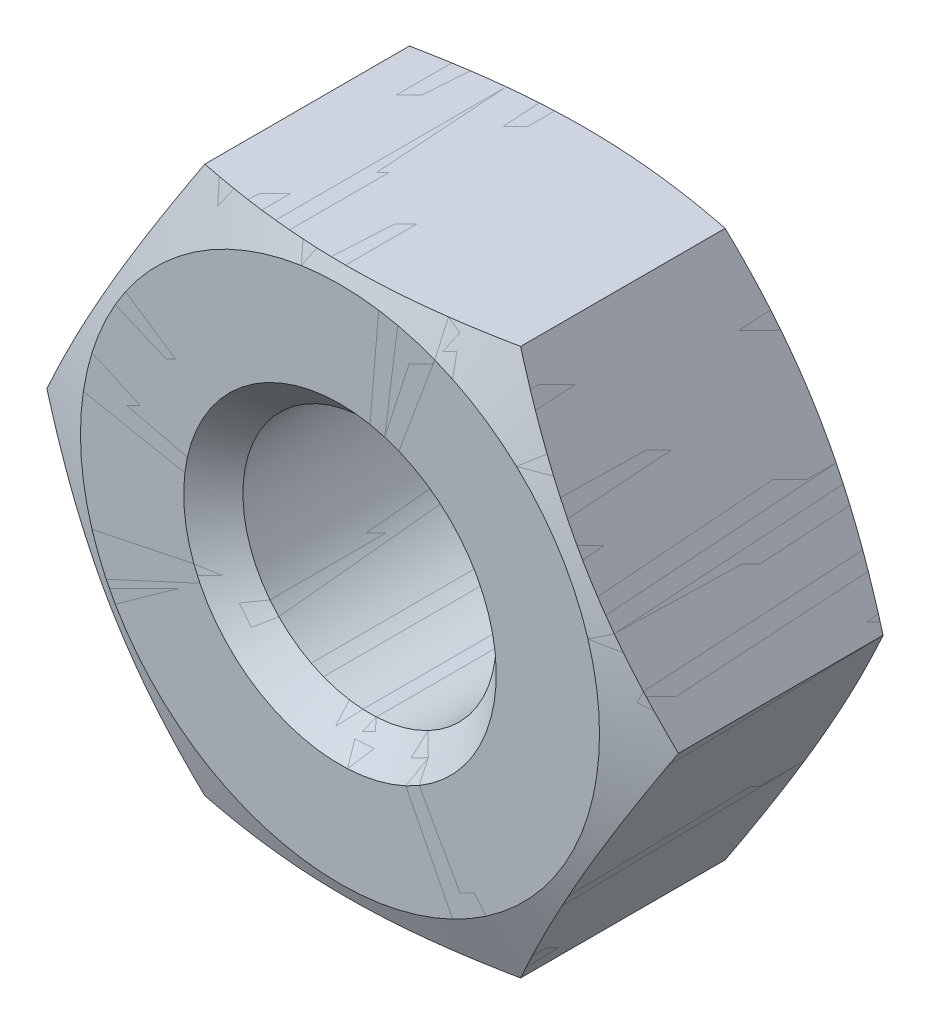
ISO-10303-21;
HEADER;
FILE_DESCRIPTION(('STEP AP214'),'2;1');
FILE_NAME('part.step','',(''),(''),'','','');
FILE_SCHEMA(('AUTOMOTIVE_DESIGN { 1 0 10303 214 1 1 1 1 }'));
ENDSEC;
DATA;
#1=APPLICATION_CONTEXT('core data for automotive mechanical design processes');
#2=APPLICATION_PROTOCOL_DEFINITION('international standard','automotive_design',2000,#1);
#3=PRODUCT_CONTEXT('',#1,'mechanical');
#4=PRODUCT('Part','Part','',(#3));
#5=PRODUCT_RELATED_PRODUCT_CATEGORY('part','',(#4));
#6=PRODUCT_DEFINITION_FORMATION('','',#4);
#7=PRODUCT_DEFINITION_CONTEXT('part definition',#1,'design');
#8=PRODUCT_DEFINITION('design','',#6,#7);
#9=PRODUCT_DEFINITION_SHAPE('','',#8);
#10=(LENGTH_UNIT() NAMED_UNIT(*) SI_UNIT(.MILLI.,.METRE.));
#11=(NAMED_UNIT(*) PLANE_ANGLE_UNIT() SI_UNIT($,.RADIAN.));
#12=(NAMED_UNIT(*) SI_UNIT($,.STERADIAN.) SOLID_ANGLE_UNIT());
#13=UNCERTAINTY_MEASURE_WITH_UNIT(LENGTH_MEASURE(1.E-05),#10,'distance_accuracy_value','');
#14=(GEOMETRIC_REPRESENTATION_CONTEXT(3) GLOBAL_UNCERTAINTY_ASSIGNED_CONTEXT((#13)) GLOBAL_UNIT_ASSIGNED_CONTEXT((#10,
#11,#12)) REPRESENTATION_CONTEXT('',''));
#15=CARTESIAN_POINT('',(0.,0.,0.));
#16=DIRECTION('',(0.,0.,1.));
#17=DIRECTION('',(1.,0.,0.));
#18=AXIS2_PLACEMENT_3D('',#15,#16,#17);
#19=CARTESIAN_POINT('',(4.04145,0.,3.2));
#20=DIRECTION('',(0.,0.,1.));
#21=DIRECTION('',(1.,0.,0.));
#22=AXIS2_PLACEMENT_3D('',#19,#20,#21);
#23=PLANE('',#22);
#24=CARTESIAN_POINT('',(0.,0.,3.2));
#25=DIRECTION('',(0.,0.,-1.));
#26=DIRECTION('',(0.,1.,0.));
#27=AXIS2_PLACEMENT_3D('',#24,#25,#26);
#28=CIRCLE('',#27,2.);
#29=CARTESIAN_POINT('',(0.,2.,3.2));
#30=VERTEX_POINT('',#29);
#31=EDGE_CURVE('P0_E540',#30,#30,#28,.T.);
#32=ORIENTED_EDGE('',*,*,#31,.T.);
#33=EDGE_LOOP('',(#32));
#34=FACE_BOUND('',#33,.T.);
#35=CARTESIAN_POINT('',(0.,0.,3.2));
#36=DIRECTION('',(0.,0.,-1.));
#37=DIRECTION('',(0.,1.,0.));
#38=AXIS2_PLACEMENT_3D('',#35,#36,#37);
#39=CIRCLE('',#38,3.32142473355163);
#40=CARTESIAN_POINT('',(0.,3.32142473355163,3.2));
#41=VERTEX_POINT('',#40);
#42=EDGE_CURVE('P0_E543',#41,#41,#39,.T.);
#43=ORIENTED_EDGE('',*,*,#42,.F.);
#44=EDGE_LOOP('',(#43));
#45=FACE_BOUND('',#44,.T.);
#46=ADVANCED_FACE('P0_F350',(#34,#45),#23,.T.);
#47=CARTESIAN_POINT('',(0.,0.,3.2));
#48=DIRECTION('',(0.,0.,1.));
#49=DIRECTION('',(0.,-1.,0.));
#50=AXIS2_PLACEMENT_3D('',#47,#48,#49);
#51=CONICAL_SURFACE('',#50,2.,0.785398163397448);
#52=CARTESIAN_POINT('',(0.,0.,2.821125));
#53=DIRECTION('',(0.,0.,-1.));
#54=DIRECTION('',(0.,1.,0.));
#55=AXIS2_PLACEMENT_3D('',#52,#53,#54);
#56=CIRCLE('',#55,1.621125);
#57=CARTESIAN_POINT('',(0.,1.621125,2.821125));
#58=VERTEX_POINT('',#57);
#59=EDGE_CURVE('P0_E431',#58,#58,#56,.T.);
#60=ORIENTED_EDGE('',*,*,#59,.T.);
#61=EDGE_LOOP('',(#60));
#62=FACE_BOUND('',#61,.T.);
#63=ORIENTED_EDGE('',*,*,#31,.F.);
#64=EDGE_LOOP('',(#63));
#65=FACE_BOUND('',#64,.T.);
#66=ADVANCED_FACE('P0_F474',(#62,#65),#51,.F.);
#67=CARTESIAN_POINT('',(0.,0.,0.));
#68=DIRECTION('',(0.,0.,-1.));
#69=DIRECTION('',(0.,1.,0.));
#70=AXIS2_PLACEMENT_3D('',#67,#68,#69);
#71=CYLINDRICAL_SURFACE('',#70,1.621125);
#72=CARTESIAN_POINT('',(0.,0.,0.378875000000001));
#73=DIRECTION('',(0.,0.,-1.));
#74=DIRECTION('',(0.,1.,0.));
#75=AXIS2_PLACEMENT_3D('',#72,#73,#74);
#76=CIRCLE('',#75,1.621125);
#77=CARTESIAN_POINT('',(0.,1.621125,0.378875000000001));
#78=VERTEX_POINT('',#77);
#79=EDGE_CURVE('P0_E428',#78,#78,#76,.T.);
#80=ORIENTED_EDGE('',*,*,#79,.T.);
#81=EDGE_LOOP('',(#80));
#82=FACE_BOUND('',#81,.T.);
#83=ORIENTED_EDGE('',*,*,#59,.F.);
#84=EDGE_LOOP('',(#83));
#85=FACE_BOUND('',#84,.T.);
#86=ADVANCED_FACE('P0_F535',(#82,#85),#71,.F.);
#87=CARTESIAN_POINT('',(0.,0.,0.));
#88=DIRECTION('',(0.,0.,-1.));
#89=DIRECTION('',(0.,1.,0.));
#90=AXIS2_PLACEMENT_3D('',#87,#88,#89);
#91=CONICAL_SURFACE('',#90,2.,0.785398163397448);
#92=ORIENTED_EDGE('',*,*,#79,.F.);
#93=EDGE_LOOP('',(#92));
#94=FACE_BOUND('',#93,.T.);
#95=CARTESIAN_POINT('',(0.,0.,0.));
#96=DIRECTION('',(0.,0.,-1.));
#97=DIRECTION('',(0.,1.,0.));
#98=AXIS2_PLACEMENT_3D('',#95,#96,#97);
#99=CIRCLE('',#98,2.);
#100=CARTESIAN_POINT('',(0.,2.,0.));
#101=VERTEX_POINT('',#100);
#102=EDGE_CURVE('P0_E544',#101,#101,#99,.T.);
#103=ORIENTED_EDGE('',*,*,#102,.T.);
#104=EDGE_LOOP('',(#103));
#105=FACE_BOUND('',#104,.T.);
#106=ADVANCED_FACE('P0_F472',(#94,#105),#91,.F.);
#107=CARTESIAN_POINT('',(0.,0.,2.90909090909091));
#108=DIRECTION('',(0.,0.,-1.));
#109=DIRECTION('',(0.,1.,0.));
#110=AXIS2_PLACEMENT_3D('',#107,#108,#109);
#111=CONICAL_SURFACE('',#110,4.04145,1.18682389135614);
#112=ORIENTED_EDGE('',*,*,#42,.T.);
#113=EDGE_LOOP('',(#112));
#114=FACE_BOUND('',#113,.T.);
#115=CARTESIAN_POINT('',(-5.34553881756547,-3.49999836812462,1.96044673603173));
#116=CARTESIAN_POINT('',(-5.187622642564,-3.49999836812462,2.01380996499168));
#117=CARTESIAN_POINT('',(-5.02949661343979,-3.49999836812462,2.06656361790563));
#118=CARTESIAN_POINT('',(-4.71271625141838,-3.49999836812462,2.17051119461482));
#119=CARTESIAN_POINT('',(-4.55406186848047,-3.49999836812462,2.22170496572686));
#120=CARTESIAN_POINT('',(-4.23576434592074,-3.49999836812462,2.32230258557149));
#121=CARTESIAN_POINT('',(-4.07611974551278,-3.49999836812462,2.37170182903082));
#122=CARTESIAN_POINT('',(-3.75611019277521,-3.49999836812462,2.46810431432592));
#123=CARTESIAN_POINT('',(-3.59574525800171,-3.49999836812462,2.51510761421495));
#124=CARTESIAN_POINT('',(-3.27623888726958,-3.49999836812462,2.60552725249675));
#125=CARTESIAN_POINT('',(-3.11710839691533,-3.49999836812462,2.64898207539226));
#126=CARTESIAN_POINT('',(-2.79787990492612,-3.49999836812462,2.73222744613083));
#127=CARTESIAN_POINT('',(-2.6377818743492,-3.49999836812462,2.77201788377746));
#128=CARTESIAN_POINT('',(-2.31659647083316,-3.49999836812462,2.84698469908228));
#129=CARTESIAN_POINT('',(-2.155509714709,-3.49999836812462,2.88216369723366));
#130=CARTESIAN_POINT('',(-1.8321870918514,-3.49999836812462,2.94682263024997));
#131=CARTESIAN_POINT('',(-1.6699512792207,-3.49999836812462,2.97630283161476));
#132=CARTESIAN_POINT('',(-1.37764525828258,-3.49999836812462,3.02301074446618));
#133=CARTESIAN_POINT('',(-1.24777946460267,-3.49999836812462,3.04151120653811));
#134=CARTESIAN_POINT('',(-0.987441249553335,-3.49999836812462,3.07350530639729));
#135=CARTESIAN_POINT('',(-0.856968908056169,-3.49999836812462,3.08699958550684));
#136=CARTESIAN_POINT('',(-0.595642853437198,-3.49999836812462,3.10845049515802));
#137=CARTESIAN_POINT('',(-0.464789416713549,-3.49999836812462,3.11641044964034));
#138=CARTESIAN_POINT('',(-0.202855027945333,-3.49999836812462,3.12645792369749));
#139=CARTESIAN_POINT('',(-0.0717740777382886,-3.49999836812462,3.12854549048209));
#140=CARTESIAN_POINT('',(0.190984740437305,-3.49999836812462,3.12674756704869));
#141=CARTESIAN_POINT('',(0.322662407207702,-3.49999836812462,3.12283294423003));
#142=CARTESIAN_POINT('',(0.585711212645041,-3.49999836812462,3.10915679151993));
#143=CARTESIAN_POINT('',(0.717082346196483,-3.49999836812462,3.09939516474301));
#144=CARTESIAN_POINT('',(0.979386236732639,-3.49999836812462,3.0744365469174));
#145=CARTESIAN_POINT('',(1.11031865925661,-3.49999836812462,3.05923608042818));
#146=CARTESIAN_POINT('',(1.37151539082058,-3.49999836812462,3.02397032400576));
#147=CARTESIAN_POINT('',(1.50177970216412,-3.49999836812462,3.00390505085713));
#148=CARTESIAN_POINT('',(1.93664114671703,-3.49999836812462,2.92968195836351));
#149=CARTESIAN_POINT('',(2.23962710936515,-3.49999836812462,2.86601767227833));
#150=CARTESIAN_POINT('',(2.69125776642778,-3.49999836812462,2.75881363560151));
#151=CARTESIAN_POINT('',(2.84137816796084,-3.49999836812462,2.72111258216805));
#152=CARTESIAN_POINT('',(3.14078447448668,-3.49999836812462,2.64252214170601));
#153=CARTESIAN_POINT('',(3.29007041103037,-3.49999836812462,2.60163287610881));
#154=CARTESIAN_POINT('',(3.73762538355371,-3.49999836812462,2.47491487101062));
#155=CARTESIAN_POINT('',(4.03479686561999,-3.49999836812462,2.38523175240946));
#156=CARTESIAN_POINT('',(4.62691338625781,-3.49999836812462,2.19915125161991));
#157=CARTESIAN_POINT('',(4.92185898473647,-3.49999836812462,2.10275562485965));
#158=CARTESIAN_POINT('',(5.50820436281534,-3.49999836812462,1.90603648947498));
#159=CARTESIAN_POINT('',(5.79961462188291,-3.49999836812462,1.80574407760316));
#160=CARTESIAN_POINT('',(6.38133518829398,-3.49999836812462,1.60196117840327));
#161=CARTESIAN_POINT('',(6.67164540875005,-3.49999836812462,1.49847044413));
#162=CARTESIAN_POINT('',(7.24949339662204,-3.49999836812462,1.28988691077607));
#163=CARTESIAN_POINT('',(7.53703671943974,-3.49999836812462,1.18480945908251));
#164=CARTESIAN_POINT('',(8.1114496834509,-3.49999836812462,0.972941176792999));
#165=CARTESIAN_POINT('',(8.39831940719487,-3.49999836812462,0.866150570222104));
#166=CARTESIAN_POINT('',(8.6849638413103,-3.49999836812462,0.758768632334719));
#167=B_SPLINE_CURVE_WITH_KNOTS('',3,(#115,#116,#117,#118,#119,#120,#121,#122,#123,#124,#125,
#126,#127,#128,#129,#130,#131,#132,#133,#134,#135,#136,#137,#138,#139,#140,#141,#142,#143,#144,
#145,#146,#147,#148,#149,#150,#151,#152,#153,#154,#155,#156,#157,#158,#159,#160,#161,#162,#163,
#164,#165,#166),.UNSPECIFIED.,.F.,.F.,(4,2,2,2,2,2,2,2,2,2,2,2,2,2,2,2,2,2,2,2,2,2,2,2,2,4),(0.,
0.500070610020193,1.00019001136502,1.50151328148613,2.00282439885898,2.49766131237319,
2.99251310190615,3.48708245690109,3.98162867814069,4.37507581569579,4.76847253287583,
5.16163276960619,5.55478984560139,5.94986122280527,6.34493914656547,6.74026997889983,
7.13559944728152,8.06362734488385,8.52796344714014,8.99228187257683,9.92337255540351,
10.8542206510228,11.778751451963,12.7033538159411,13.6217712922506,14.540069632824),.UNSPECIFIED.);
#168=CARTESIAN_POINT('',(-2.020725,-3.49999836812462,2.90909090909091));
#169=VERTEX_POINT('',#168);
#170=CARTESIAN_POINT('',(2.020725,-3.49999836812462,2.90909090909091));
#171=VERTEX_POINT('',#170);
#172=EDGE_CURVE('P0_E411',#169,#171,#167,.T.);
#173=ORIENTED_EDGE('',*,*,#172,.T.);
#174=CARTESIAN_POINT('',(2.02072488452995,-3.49999856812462,2.90909086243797));
#175=CARTESIAN_POINT('',(2.09132356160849,-3.37771807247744,2.93761622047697));
#176=CARTESIAN_POINT('',(2.16215525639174,-3.25503397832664,2.96399250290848));
#177=CARTESIAN_POINT('',(2.3042870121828,-3.00885455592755,3.01163623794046));
#178=CARTESIAN_POINT('',(2.37558732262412,-2.88535879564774,3.0329006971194));
#179=CARTESIAN_POINT('',(2.5185548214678,-2.63773182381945,3.06946941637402));
#180=CARTESIAN_POINT('',(2.59022189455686,-2.51360081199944,3.08477544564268));
#181=CARTESIAN_POINT('',(2.73382225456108,-2.26487769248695,3.10871799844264));
#182=CARTESIAN_POINT('',(2.80575547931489,-2.14028569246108,3.1173559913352));
#183=CARTESIAN_POINT('',(2.94852684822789,-1.89299842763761,3.1274253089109));
#184=CARTESIAN_POINT('',(3.01936284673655,-1.77030687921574,3.12897651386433));
#185=CARTESIAN_POINT('',(3.1609929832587,-1.52499628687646,3.1251148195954));
#186=CARTESIAN_POINT('',(3.23178711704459,-1.40237725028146,3.11970130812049));
#187=CARTESIAN_POINT('',(3.37311558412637,-1.15758916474,3.10220171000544));
#188=CARTESIAN_POINT('',(3.44365006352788,-1.03541986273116,3.09012025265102));
#189=CARTESIAN_POINT('',(3.58439048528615,-0.791650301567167,3.05986869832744));
#190=CARTESIAN_POINT('',(3.65459642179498,-0.670050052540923,3.04169849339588));
#191=CARTESIAN_POINT('',(3.75107738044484,-0.502940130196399,3.01297686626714));
#192=CARTESIAN_POINT('',(3.77752821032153,-0.457125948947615,3.00471206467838));
#193=CARTESIAN_POINT('',(3.83036744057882,-0.365605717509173,2.98746276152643));
#194=CARTESIAN_POINT('',(3.85675584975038,-0.319899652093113,2.97847836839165));
#195=CARTESIAN_POINT('',(3.90956275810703,-0.228435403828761,2.95979946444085));
#196=CARTESIAN_POINT('',(3.93598105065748,-0.182677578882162,2.95010262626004));
#197=CARTESIAN_POINT('',(3.98875975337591,-0.0912621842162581,2.93006727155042));
#198=CARTESIAN_POINT('',(4.01512015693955,-0.0456046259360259,2.91972868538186));
#199=CARTESIAN_POINT('',(4.04145011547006,2.00000000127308E-07,2.90909086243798));
#200=B_SPLINE_CURVE_WITH_KNOTS('',3,(#174,#175,#176,#177,#178,#179,#180,#181,#182,#183,#184,
#185,#186,#187,#188,#189,#190,#191,#192,#193,#194,#195,#196,#197,#198,#199),.UNSPECIFIED.,.F.,
.F.,(4,2,2,2,2,2,2,2,2,2,2,2,4),(0.,0.43218010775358,0.864612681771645,1.29691675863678,
1.72912554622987,2.15399533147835,2.5789024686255,3.00351498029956,3.42813502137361,
3.58876209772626,3.74936501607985,3.91051814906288,4.07168880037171),.UNSPECIFIED.);
#201=CARTESIAN_POINT('',(4.04145,0.,2.90909090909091));
#202=VERTEX_POINT('',#201);
#203=EDGE_CURVE('P0_E496',#171,#202,#200,.T.);
#204=ORIENTED_EDGE('',*,*,#203,.T.);
#205=CARTESIAN_POINT('',(4.04145011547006,-2.0000000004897E-07,2.90909086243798));
#206=CARTESIAN_POINT('',(3.97085143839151,0.122280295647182,2.93761622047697));
#207=CARTESIAN_POINT('',(3.90001974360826,0.244964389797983,2.96399250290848));
#208=CARTESIAN_POINT('',(3.7578879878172,0.491143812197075,3.01163623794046));
#209=CARTESIAN_POINT('',(3.68658767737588,0.614639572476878,3.0329006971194));
#210=CARTESIAN_POINT('',(3.5436201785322,0.862266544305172,3.06946941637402));
#211=CARTESIAN_POINT('',(3.47195310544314,0.98639755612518,3.08477544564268));
#212=CARTESIAN_POINT('',(3.32835274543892,1.23512067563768,3.10871799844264));
#213=CARTESIAN_POINT('',(3.25641952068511,1.35971267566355,3.1173559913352));
#214=CARTESIAN_POINT('',(3.11364815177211,1.60699994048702,3.1274253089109));
#215=CARTESIAN_POINT('',(3.04281215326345,1.72969148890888,3.12897651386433));
#216=CARTESIAN_POINT('',(2.9011820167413,1.97500208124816,3.1251148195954));
#217=CARTESIAN_POINT('',(2.83038788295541,2.09762111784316,3.11970130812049));
#218=CARTESIAN_POINT('',(2.68905941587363,2.34240920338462,3.10220171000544));
#219=CARTESIAN_POINT('',(2.61852493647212,2.46457850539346,3.09012025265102));
#220=CARTESIAN_POINT('',(2.47778451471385,2.70834806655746,3.05986869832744));
#221=CARTESIAN_POINT('',(2.40757857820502,2.8299483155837,3.04169849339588));
#222=CARTESIAN_POINT('',(2.31109761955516,2.99705823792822,3.01297686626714));
#223=CARTESIAN_POINT('',(2.28464678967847,3.04287241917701,3.00471206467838));
#224=CARTESIAN_POINT('',(2.23180755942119,3.13439265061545,2.98746276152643));
#225=CARTESIAN_POINT('',(2.20541915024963,3.18009871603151,2.97847836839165));
#226=CARTESIAN_POINT('',(2.15261224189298,3.27156296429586,2.95979946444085));
#227=CARTESIAN_POINT('',(2.12619394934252,3.31732078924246,2.95010262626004));
#228=CARTESIAN_POINT('',(2.07341524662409,3.40873618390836,2.93006727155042));
#229=CARTESIAN_POINT('',(2.04705484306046,3.4543937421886,2.91972868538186));
#230=CARTESIAN_POINT('',(2.02072488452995,3.49999856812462,2.90909086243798));
#231=B_SPLINE_CURVE_WITH_KNOTS('',3,(#205,#206,#207,#208,#209,#210,#211,#212,#213,#214,#215,
#216,#217,#218,#219,#220,#221,#222,#223,#224,#225,#226,#227,#228,#229,#230),.UNSPECIFIED.,.F.,
.F.,(4,2,2,2,2,2,2,2,2,2,2,2,4),(0.,0.432180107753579,0.864612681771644,1.29691675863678,
1.72912554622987,2.15399533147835,2.5789024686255,3.00351498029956,3.42813502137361,
3.58876209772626,3.74936501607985,3.91051814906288,4.07168880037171),.UNSPECIFIED.);
#232=CARTESIAN_POINT('',(2.020725,3.49999836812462,2.90909090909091));
#233=VERTEX_POINT('',#232);
#234=EDGE_CURVE('P0_E373',#202,#233,#231,.T.);
#235=ORIENTED_EDGE('',*,*,#234,.T.);
#236=CARTESIAN_POINT('',(-5.34553881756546,3.49999836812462,1.96044673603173));
#237=CARTESIAN_POINT('',(-5.18762264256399,3.49999836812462,2.01380996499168));
#238=CARTESIAN_POINT('',(-5.02949661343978,3.49999836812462,2.06656361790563));
#239=CARTESIAN_POINT('',(-4.71271625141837,3.49999836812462,2.17051119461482));
#240=CARTESIAN_POINT('',(-4.55406186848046,3.49999836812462,2.22170496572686));
#241=CARTESIAN_POINT('',(-4.23576434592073,3.49999836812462,2.32230258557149));
#242=CARTESIAN_POINT('',(-4.07611974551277,3.49999836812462,2.37170182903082));
#243=CARTESIAN_POINT('',(-3.7561101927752,3.49999836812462,2.46810431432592));
#244=CARTESIAN_POINT('',(-3.5957452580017,3.49999836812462,2.51510761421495));
#245=CARTESIAN_POINT('',(-3.27623888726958,3.49999836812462,2.60552725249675));
#246=CARTESIAN_POINT('',(-3.11710839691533,3.49999836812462,2.64898207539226));
#247=CARTESIAN_POINT('',(-2.79787990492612,3.49999836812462,2.73222744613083));
#248=CARTESIAN_POINT('',(-2.63778187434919,3.49999836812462,2.77201788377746));
#249=CARTESIAN_POINT('',(-2.31659647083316,3.49999836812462,2.84698469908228));
#250=CARTESIAN_POINT('',(-2.155509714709,3.49999836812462,2.88216369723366));
#251=CARTESIAN_POINT('',(-1.8321870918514,3.49999836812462,2.94682263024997));
#252=CARTESIAN_POINT('',(-1.6699512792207,3.49999836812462,2.97630283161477));
#253=CARTESIAN_POINT('',(-1.37764525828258,3.49999836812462,3.02301074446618));
#254=CARTESIAN_POINT('',(-1.24777946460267,3.49999836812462,3.04151120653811));
#255=CARTESIAN_POINT('',(-0.987441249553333,3.49999836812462,3.07350530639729));
#256=CARTESIAN_POINT('',(-0.856968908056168,3.49999836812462,3.08699958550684));
#257=CARTESIAN_POINT('',(-0.595642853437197,3.49999836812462,3.10845049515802));
#258=CARTESIAN_POINT('',(-0.464789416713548,3.49999836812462,3.11641044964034));
#259=CARTESIAN_POINT('',(-0.202855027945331,3.49999836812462,3.12645792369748));
#260=CARTESIAN_POINT('',(-0.0717740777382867,3.49999836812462,3.12854549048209));
#261=CARTESIAN_POINT('',(0.190984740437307,3.49999836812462,3.12674756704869));
#262=CARTESIAN_POINT('',(0.322662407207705,3.49999836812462,3.12283294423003));
#263=CARTESIAN_POINT('',(0.585711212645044,3.49999836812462,3.10915679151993));
#264=CARTESIAN_POINT('',(0.717082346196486,3.49999836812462,3.09939516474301));
#265=CARTESIAN_POINT('',(0.979386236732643,3.49999836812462,3.0744365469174));
#266=CARTESIAN_POINT('',(1.11031865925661,3.49999836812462,3.05923608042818));
#267=CARTESIAN_POINT('',(1.37151539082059,3.49999836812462,3.02397032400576));
#268=CARTESIAN_POINT('',(1.50177970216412,3.49999836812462,3.00390505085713));
#269=CARTESIAN_POINT('',(1.93664114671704,3.49999836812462,2.92968195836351));
#270=CARTESIAN_POINT('',(2.23962710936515,3.49999836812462,2.86601767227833));
#271=CARTESIAN_POINT('',(2.69125776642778,3.49999836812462,2.75881363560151));
#272=CARTESIAN_POINT('',(2.84137816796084,3.49999836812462,2.72111258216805));
#273=CARTESIAN_POINT('',(3.14078447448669,3.49999836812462,2.64252214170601));
#274=CARTESIAN_POINT('',(3.29007041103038,3.49999836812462,2.60163287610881));
#275=CARTESIAN_POINT('',(3.73762538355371,3.49999836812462,2.47491487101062));
#276=CARTESIAN_POINT('',(4.03479686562,3.49999836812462,2.38523175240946));
#277=CARTESIAN_POINT('',(4.62691338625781,3.49999836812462,2.19915125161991));
#278=CARTESIAN_POINT('',(4.92185898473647,3.49999836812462,2.10275562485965));
#279=CARTESIAN_POINT('',(5.50820436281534,3.49999836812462,1.90603648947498));
#280=CARTESIAN_POINT('',(5.79961462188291,3.49999836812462,1.80574407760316));
#281=CARTESIAN_POINT('',(6.38133518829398,3.49999836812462,1.60196117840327));
#282=CARTESIAN_POINT('',(6.67164540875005,3.49999836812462,1.49847044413));
#283=CARTESIAN_POINT('',(7.24949339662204,3.49999836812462,1.28988691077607));
#284=CARTESIAN_POINT('',(7.53703671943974,3.49999836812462,1.18480945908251));
#285=CARTESIAN_POINT('',(8.1114496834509,3.49999836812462,0.972941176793));
#286=CARTESIAN_POINT('',(8.39831940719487,3.49999836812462,0.866150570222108));
#287=CARTESIAN_POINT('',(8.6849638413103,3.49999836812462,0.758768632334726));
#288=B_SPLINE_CURVE_WITH_KNOTS('',3,(#236,#237,#238,#239,#240,#241,#242,#243,#244,#245,#246,
#247,#248,#249,#250,#251,#252,#253,#254,#255,#256,#257,#258,#259,#260,#261,#262,#263,#264,#265,
#266,#267,#268,#269,#270,#271,#272,#273,#274,#275,#276,#277,#278,#279,#280,#281,#282,#283,#284,
#285,#286,#287),.UNSPECIFIED.,.F.,.F.,(4,2,2,2,2,2,2,2,2,2,2,2,2,2,2,2,2,2,2,2,2,2,2,2,2,4),(0.,
0.500070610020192,1.00019001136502,1.50151328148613,2.00282439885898,2.49766131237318,
2.99251310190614,3.48708245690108,3.98162867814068,4.37507581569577,4.76847253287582,
5.16163276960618,5.55478984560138,5.94986122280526,6.34493914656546,6.74026997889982,
7.13559944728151,8.06362734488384,8.52796344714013,8.99228187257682,9.9233725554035,
10.8542206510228,11.778751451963,12.7033538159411,13.6217712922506,14.540069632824),.UNSPECIFIED.);
#289=CARTESIAN_POINT('',(-2.020725,3.49999836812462,2.90909090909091));
#290=VERTEX_POINT('',#289);
#291=EDGE_CURVE('P0_E487',#233,#290,#288,.F.);
#292=ORIENTED_EDGE('',*,*,#291,.T.);
#293=CARTESIAN_POINT('',(-2.02072488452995,3.49999856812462,2.90909086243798));
#294=CARTESIAN_POINT('',(-2.09132356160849,3.37771807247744,2.93761622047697));
#295=CARTESIAN_POINT('',(-2.16215525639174,3.25503397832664,2.96399250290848));
#296=CARTESIAN_POINT('',(-2.3042870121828,3.00885455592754,3.01163623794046));
#297=CARTESIAN_POINT('',(-2.37558732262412,2.88535879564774,3.0329006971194));
#298=CARTESIAN_POINT('',(-2.5185548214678,2.63773182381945,3.06946941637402));
#299=CARTESIAN_POINT('',(-2.59022189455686,2.51360081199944,3.08477544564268));
#300=CARTESIAN_POINT('',(-2.73382225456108,2.26487769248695,3.10871799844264));
#301=CARTESIAN_POINT('',(-2.80575547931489,2.14028569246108,3.1173559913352));
#302=CARTESIAN_POINT('',(-2.94852684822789,1.89299842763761,3.1274253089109));
#303=CARTESIAN_POINT('',(-3.01936284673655,1.77030687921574,3.12897651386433));
#304=CARTESIAN_POINT('',(-3.1609929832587,1.52499628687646,3.1251148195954));
#305=CARTESIAN_POINT('',(-3.23178711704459,1.40237725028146,3.11970130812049));
#306=CARTESIAN_POINT('',(-3.37311558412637,1.15758916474,3.10220171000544));
#307=CARTESIAN_POINT('',(-3.44365006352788,1.03541986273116,3.09012025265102));
#308=CARTESIAN_POINT('',(-3.58439048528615,0.791650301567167,3.05986869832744));
#309=CARTESIAN_POINT('',(-3.65459642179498,0.670050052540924,3.04169849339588));
#310=CARTESIAN_POINT('',(-3.75107738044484,0.502940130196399,3.01297686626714));
#311=CARTESIAN_POINT('',(-3.77752821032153,0.457125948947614,3.00471206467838));
#312=CARTESIAN_POINT('',(-3.83036744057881,0.365605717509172,2.98746276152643));
#313=CARTESIAN_POINT('',(-3.85675584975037,0.319899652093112,2.97847836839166));
#314=CARTESIAN_POINT('',(-3.90956275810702,0.22843540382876,2.95979946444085));
#315=CARTESIAN_POINT('',(-3.93598105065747,0.182677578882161,2.95010262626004));
#316=CARTESIAN_POINT('',(-3.98875975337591,0.0912621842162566,2.93006727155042));
#317=CARTESIAN_POINT('',(-4.01512015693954,0.0456046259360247,2.91972868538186));
#318=CARTESIAN_POINT('',(-4.04145011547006,-2.00000000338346E-07,2.90909086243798));
#319=B_SPLINE_CURVE_WITH_KNOTS('',3,(#293,#294,#295,#296,#297,#298,#299,#300,#301,#302,#303,
#304,#305,#306,#307,#308,#309,#310,#311,#312,#313,#314,#315,#316,#317,#318),.UNSPECIFIED.,.F.,
.F.,(4,2,2,2,2,2,2,2,2,2,2,2,4),(0.,0.43218010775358,0.864612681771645,1.29691675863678,
1.72912554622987,2.15399533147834,2.5789024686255,3.00351498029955,3.42813502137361,
3.58876209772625,3.74936501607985,3.91051814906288,4.07168880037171),.UNSPECIFIED.);
#320=CARTESIAN_POINT('',(-4.04145,0.,2.90909090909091));
#321=VERTEX_POINT('',#320);
#322=EDGE_CURVE('P0_E482',#290,#321,#319,.T.);
#323=ORIENTED_EDGE('',*,*,#322,.T.);
#324=CARTESIAN_POINT('',(-4.04145011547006,1.99999999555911E-07,2.90909086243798));
#325=CARTESIAN_POINT('',(-3.97085143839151,-0.122280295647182,2.93761622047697));
#326=CARTESIAN_POINT('',(-3.90001974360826,-0.244964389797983,2.96399250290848));
#327=CARTESIAN_POINT('',(-3.7578879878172,-0.491143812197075,3.01163623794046));
#328=CARTESIAN_POINT('',(-3.68658767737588,-0.614639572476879,3.0329006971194));
#329=CARTESIAN_POINT('',(-3.5436201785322,-0.862266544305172,3.06946941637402));
#330=CARTESIAN_POINT('',(-3.47195310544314,-0.98639755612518,3.08477544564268));
#331=CARTESIAN_POINT('',(-3.32835274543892,-1.23512067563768,3.10871799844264));
#332=CARTESIAN_POINT('',(-3.25641952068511,-1.35971267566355,3.1173559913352));
#333=CARTESIAN_POINT('',(-3.11364815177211,-1.60699994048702,3.1274253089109));
#334=CARTESIAN_POINT('',(-3.04281215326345,-1.72969148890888,3.12897651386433));
#335=CARTESIAN_POINT('',(-2.9011820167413,-1.97500208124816,3.1251148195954));
#336=CARTESIAN_POINT('',(-2.83038788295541,-2.09762111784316,3.11970130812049));
#337=CARTESIAN_POINT('',(-2.68905941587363,-2.34240920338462,3.10220171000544));
#338=CARTESIAN_POINT('',(-2.61852493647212,-2.46457850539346,3.09012025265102));
#339=CARTESIAN_POINT('',(-2.47778451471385,-2.70834806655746,3.05986869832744));
#340=CARTESIAN_POINT('',(-2.40757857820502,-2.8299483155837,3.04169849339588));
#341=CARTESIAN_POINT('',(-2.31109761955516,-2.99705823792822,3.01297686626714));
#342=CARTESIAN_POINT('',(-2.28464678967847,-3.04287241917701,3.00471206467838));
#343=CARTESIAN_POINT('',(-2.23180755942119,-3.13439265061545,2.98746276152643));
#344=CARTESIAN_POINT('',(-2.20541915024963,-3.18009871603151,2.97847836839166));
#345=CARTESIAN_POINT('',(-2.15261224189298,-3.27156296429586,2.95979946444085));
#346=CARTESIAN_POINT('',(-2.12619394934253,-3.31732078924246,2.95010262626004));
#347=CARTESIAN_POINT('',(-2.07341524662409,-3.40873618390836,2.93006727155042));
#348=CARTESIAN_POINT('',(-2.04705484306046,-3.45439374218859,2.91972868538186));
#349=CARTESIAN_POINT('',(-2.02072488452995,-3.49999856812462,2.90909086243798));
#350=B_SPLINE_CURVE_WITH_KNOTS('',3,(#324,#325,#326,#327,#328,#329,#330,#331,#332,#333,#334,
#335,#336,#337,#338,#339,#340,#341,#342,#343,#344,#345,#346,#347,#348,#349),.UNSPECIFIED.,.F.,
.F.,(4,2,2,2,2,2,2,2,2,2,2,2,4),(0.,0.432180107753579,0.864612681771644,1.29691675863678,
1.72912554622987,2.15399533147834,2.5789024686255,3.00351498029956,3.42813502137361,
3.58876209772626,3.74936501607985,3.91051814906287,4.07168880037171),.UNSPECIFIED.);
#351=EDGE_CURVE('P0_E459',#321,#169,#350,.T.);
#352=ORIENTED_EDGE('',*,*,#351,.T.);
#353=EDGE_LOOP('',(#173,#204,#235,#292,#323,#352));
#354=FACE_BOUND('',#353,.T.);
#355=ADVANCED_FACE('P0_F468',(#114,#354),#111,.T.);
#356=CARTESIAN_POINT('',(2.020725,-3.49999836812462,3.2));
#357=DIRECTION('',(-0.866025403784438,0.5,0.));
#358=DIRECTION('',(-0.5,-0.866025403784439,0.));
#359=AXIS2_PLACEMENT_3D('',#356,#357,#358);
#360=PLANE('',#359);
#361=ORIENTED_EDGE('',*,*,#203,.F.);
#362=DIRECTION('',(0.,0.,-1.));
#363=VECTOR('',#362,1.);
#364=CARTESIAN_POINT('',(2.020725,-3.49999836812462,3.2));
#365=LINE('',#364,#363);
#366=CARTESIAN_POINT('',(2.020725,-3.49999836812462,0.290909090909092));
#367=VERTEX_POINT('',#366);
#368=EDGE_CURVE('P0_E415',#171,#367,#365,.T.);
#369=ORIENTED_EDGE('',*,*,#368,.T.);
#370=CARTESIAN_POINT('',(4.04145011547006,1.99999999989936E-07,0.290909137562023));
#371=CARTESIAN_POINT('',(3.97085143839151,-0.122280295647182,0.262383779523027));
#372=CARTESIAN_POINT('',(3.90001974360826,-0.244964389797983,0.236007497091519));
#373=CARTESIAN_POINT('',(3.7578879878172,-0.491143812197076,0.188363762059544));
#374=CARTESIAN_POINT('',(3.68658767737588,-0.614639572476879,0.1670993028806));
#375=CARTESIAN_POINT('',(3.5436201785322,-0.862266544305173,0.130530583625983));
#376=CARTESIAN_POINT('',(3.47195310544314,-0.98639755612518,0.115224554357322));
#377=CARTESIAN_POINT('',(3.32835274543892,-1.23512067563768,0.0912820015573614));
#378=CARTESIAN_POINT('',(3.25641952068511,-1.35971267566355,0.0826440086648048));
#379=CARTESIAN_POINT('',(3.11364815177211,-1.60699994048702,0.0725746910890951));
#380=CARTESIAN_POINT('',(3.04281215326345,-1.72969148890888,0.0710234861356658));
#381=CARTESIAN_POINT('',(2.9011820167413,-1.97500208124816,0.0748851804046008));
#382=CARTESIAN_POINT('',(2.83038788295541,-2.09762111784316,0.0802986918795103));
#383=CARTESIAN_POINT('',(2.68905941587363,-2.34240920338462,0.0977982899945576));
#384=CARTESIAN_POINT('',(2.61852493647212,-2.46457850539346,0.109879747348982));
#385=CARTESIAN_POINT('',(2.47778451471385,-2.70834806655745,0.140131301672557));
#386=CARTESIAN_POINT('',(2.40757857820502,-2.8299483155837,0.158301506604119));
#387=CARTESIAN_POINT('',(2.31109761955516,-2.99705823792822,0.187023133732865));
#388=CARTESIAN_POINT('',(2.28464678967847,-3.04287241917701,0.195287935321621));
#389=CARTESIAN_POINT('',(2.23180755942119,-3.13439265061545,0.21253723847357));
#390=CARTESIAN_POINT('',(2.20541915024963,-3.18009871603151,0.221521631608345));
#391=CARTESIAN_POINT('',(2.15261224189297,-3.27156296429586,0.24020053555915));
#392=CARTESIAN_POINT('',(2.12619394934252,-3.31732078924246,0.249897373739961));
#393=CARTESIAN_POINT('',(2.07341524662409,-3.40873618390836,0.269932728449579));
#394=CARTESIAN_POINT('',(2.04705484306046,-3.4543937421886,0.280271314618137));
#395=CARTESIAN_POINT('',(2.02072488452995,-3.49999856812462,0.290909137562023));
#396=B_SPLINE_CURVE_WITH_KNOTS('',3,(#370,#371,#372,#373,#374,#375,#376,#377,#378,#379,#380,
#381,#382,#383,#384,#385,#386,#387,#388,#389,#390,#391,#392,#393,#394,#395),.UNSPECIFIED.,.F.,
.F.,(4,2,2,2,2,2,2,2,2,2,2,2,4),(0.,0.432180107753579,0.864612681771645,1.29691675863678,
1.72912554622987,2.15399533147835,2.5789024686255,3.00351498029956,3.42813502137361,
3.58876209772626,3.74936501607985,3.91051814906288,4.07168880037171),.UNSPECIFIED.);
#397=CARTESIAN_POINT('',(4.04145,0.,0.290909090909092));
#398=VERTEX_POINT('',#397);
#399=EDGE_CURVE('P0_E366',#398,#367,#396,.T.);
#400=ORIENTED_EDGE('',*,*,#399,.F.);
#401=DIRECTION('',(0.,0.,-1.));
#402=VECTOR('',#401,1.);
#403=CARTESIAN_POINT('',(4.04145,0.,3.2));
#404=LINE('',#403,#402);
#405=EDGE_CURVE('P0_E359',#202,#398,#404,.T.);
#406=ORIENTED_EDGE('',*,*,#405,.F.);
#407=EDGE_LOOP('',(#361,#369,#400,#406));
#408=FACE_BOUND('',#407,.T.);
#409=ADVANCED_FACE('P0_F352',(#408),#360,.F.);
#410=CARTESIAN_POINT('',(4.04145,0.,3.2));
#411=DIRECTION('',(-0.866025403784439,-0.5,0.));
#412=DIRECTION('',(0.5,-0.866025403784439,0.));
#413=AXIS2_PLACEMENT_3D('',#410,#411,#412);
#414=PLANE('',#413);
#415=ORIENTED_EDGE('',*,*,#234,.F.);
#416=ORIENTED_EDGE('',*,*,#405,.T.);
#417=CARTESIAN_POINT('',(2.02072488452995,3.49999856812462,0.290909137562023));
#418=CARTESIAN_POINT('',(2.09132356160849,3.37771807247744,0.262383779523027));
#419=CARTESIAN_POINT('',(2.16215525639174,3.25503397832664,0.236007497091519));
#420=CARTESIAN_POINT('',(2.3042870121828,3.00885455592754,0.188363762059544));
#421=CARTESIAN_POINT('',(2.37558732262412,2.88535879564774,0.167099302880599));
#422=CARTESIAN_POINT('',(2.5185548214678,2.63773182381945,0.130530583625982));
#423=CARTESIAN_POINT('',(2.59022189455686,2.51360081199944,0.115224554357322));
#424=CARTESIAN_POINT('',(2.73382225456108,2.26487769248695,0.0912820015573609));
#425=CARTESIAN_POINT('',(2.80575547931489,2.14028569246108,0.0826440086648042));
#426=CARTESIAN_POINT('',(2.94852684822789,1.8929984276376,0.0725746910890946));
#427=CARTESIAN_POINT('',(3.01936284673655,1.77030687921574,0.0710234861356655));
#428=CARTESIAN_POINT('',(3.1609929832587,1.52499628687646,0.0748851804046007));
#429=CARTESIAN_POINT('',(3.23178711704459,1.40237725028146,0.0802986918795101));
#430=CARTESIAN_POINT('',(3.37311558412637,1.15758916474,0.0977982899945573));
#431=CARTESIAN_POINT('',(3.44365006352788,1.03541986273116,0.109879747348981));
#432=CARTESIAN_POINT('',(3.58439048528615,0.791650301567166,0.140131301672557));
#433=CARTESIAN_POINT('',(3.65459642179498,0.670050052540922,0.158301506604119));
#434=CARTESIAN_POINT('',(3.75107738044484,0.502940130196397,0.187023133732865));
#435=CARTESIAN_POINT('',(3.77752821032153,0.457125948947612,0.195287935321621));
#436=CARTESIAN_POINT('',(3.83036744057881,0.365605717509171,0.21253723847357));
#437=CARTESIAN_POINT('',(3.85675584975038,0.319899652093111,0.221521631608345));
#438=CARTESIAN_POINT('',(3.90956275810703,0.228435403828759,0.240200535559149));
#439=CARTESIAN_POINT('',(3.93598105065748,0.18267757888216,0.249897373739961));
#440=CARTESIAN_POINT('',(3.98875975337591,0.0912621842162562,0.269932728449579));
#441=CARTESIAN_POINT('',(4.01512015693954,0.0456046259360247,0.280271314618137));
#442=CARTESIAN_POINT('',(4.04145011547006,-2.00000000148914E-07,0.290909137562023));
#443=B_SPLINE_CURVE_WITH_KNOTS('',3,(#417,#418,#419,#420,#421,#422,#423,#424,#425,#426,#427,
#428,#429,#430,#431,#432,#433,#434,#435,#436,#437,#438,#439,#440,#441,#442),.UNSPECIFIED.,.F.,
.F.,(4,2,2,2,2,2,2,2,2,2,2,2,4),(0.,0.43218010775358,0.864612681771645,1.29691675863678,
1.72912554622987,2.15399533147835,2.5789024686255,3.00351498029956,3.42813502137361,
3.58876209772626,3.74936501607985,3.91051814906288,4.07168880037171),.UNSPECIFIED.);
#444=CARTESIAN_POINT('',(2.020725,3.49999836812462,0.290909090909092));
#445=VERTEX_POINT('',#444);
#446=EDGE_CURVE('P0_E507',#445,#398,#443,.T.);
#447=ORIENTED_EDGE('',*,*,#446,.F.);
#448=DIRECTION('',(0.,0.,-1.));
#449=VECTOR('',#448,1.);
#450=CARTESIAN_POINT('',(2.020725,3.49999836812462,3.2));
#451=LINE('',#450,#449);
#452=EDGE_CURVE('P0_E596',#233,#445,#451,.T.);
#453=ORIENTED_EDGE('',*,*,#452,.F.);
#454=EDGE_LOOP('',(#415,#416,#447,#453));
#455=FACE_BOUND('',#454,.T.);
#456=ADVANCED_FACE('P0_F501',(#455),#414,.F.);
#457=CARTESIAN_POINT('',(2.020725,3.49999836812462,3.2));
#458=DIRECTION('',(0.,-1.,0.));
#459=DIRECTION('',(1.,0.,0.));
#460=AXIS2_PLACEMENT_3D('',#457,#458,#459);
#461=PLANE('',#460);
#462=ORIENTED_EDGE('',*,*,#291,.F.);
#463=ORIENTED_EDGE('',*,*,#452,.T.);
#464=CARTESIAN_POINT('',(-5.34553881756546,3.49999836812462,1.23955326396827));
#465=CARTESIAN_POINT('',(-5.18762264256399,3.49999836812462,1.18619003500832));
#466=CARTESIAN_POINT('',(-5.02949661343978,3.49999836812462,1.13343638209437));
#467=CARTESIAN_POINT('',(-4.71271625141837,3.49999836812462,1.02948880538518));
#468=CARTESIAN_POINT('',(-4.55406186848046,3.49999836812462,0.978295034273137));
#469=CARTESIAN_POINT('',(-4.23576434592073,3.49999836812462,0.877697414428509));
#470=CARTESIAN_POINT('',(-4.07611974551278,3.49999836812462,0.82829817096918));
#471=CARTESIAN_POINT('',(-3.7561101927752,3.49999836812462,0.73189568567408));
#472=CARTESIAN_POINT('',(-3.5957452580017,3.49999836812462,0.684892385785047));
#473=CARTESIAN_POINT('',(-3.27623888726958,3.49999836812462,0.594472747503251));
#474=CARTESIAN_POINT('',(-3.11710839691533,3.49999836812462,0.551017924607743));
#475=CARTESIAN_POINT('',(-2.79787990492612,3.49999836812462,0.467772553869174));
#476=CARTESIAN_POINT('',(-2.63778187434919,3.49999836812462,0.427982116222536));
#477=CARTESIAN_POINT('',(-2.31659647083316,3.49999836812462,0.35301530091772));
#478=CARTESIAN_POINT('',(-2.155509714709,3.49999836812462,0.317836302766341));
#479=CARTESIAN_POINT('',(-1.8321870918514,3.49999836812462,0.253177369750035));
#480=CARTESIAN_POINT('',(-1.6699512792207,3.49999836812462,0.223697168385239));
#481=CARTESIAN_POINT('',(-1.37764525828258,3.49999836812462,0.176989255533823));
#482=CARTESIAN_POINT('',(-1.24777946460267,3.49999836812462,0.158488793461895));
#483=CARTESIAN_POINT('',(-0.987441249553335,3.49999836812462,0.126494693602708));
#484=CARTESIAN_POINT('',(-0.856968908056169,3.49999836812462,0.113000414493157));
#485=CARTESIAN_POINT('',(-0.595642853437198,3.49999836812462,0.091549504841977));
#486=CARTESIAN_POINT('',(-0.464789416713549,3.49999836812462,0.0835895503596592));
#487=CARTESIAN_POINT('',(-0.202855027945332,3.49999836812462,0.0735420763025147));
#488=CARTESIAN_POINT('',(-0.0717740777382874,3.49999836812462,0.0714545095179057));
#489=CARTESIAN_POINT('',(0.190984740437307,3.49999836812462,0.0732524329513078));
#490=CARTESIAN_POINT('',(0.322662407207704,3.49999836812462,0.0771670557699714));
#491=CARTESIAN_POINT('',(0.585711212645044,3.49999836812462,0.090843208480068));
#492=CARTESIAN_POINT('',(0.717082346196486,3.49999836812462,0.100604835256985));
#493=CARTESIAN_POINT('',(0.979386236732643,3.49999836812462,0.125563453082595));
#494=CARTESIAN_POINT('',(1.11031865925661,3.49999836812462,0.14076391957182));
#495=CARTESIAN_POINT('',(1.37151539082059,3.49999836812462,0.176029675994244));
#496=CARTESIAN_POINT('',(1.50177970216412,3.49999836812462,0.196094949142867));
#497=CARTESIAN_POINT('',(1.93664114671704,3.49999836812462,0.270318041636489));
#498=CARTESIAN_POINT('',(2.23962710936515,3.49999836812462,0.333982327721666));
#499=CARTESIAN_POINT('',(2.69125776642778,3.49999836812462,0.441186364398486));
#500=CARTESIAN_POINT('',(2.84137816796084,3.49999836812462,0.47888741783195));
#501=CARTESIAN_POINT('',(3.14078447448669,3.49999836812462,0.557477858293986));
#502=CARTESIAN_POINT('',(3.29007041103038,3.49999836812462,0.598367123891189));
#503=CARTESIAN_POINT('',(3.73762538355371,3.49999836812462,0.725085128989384));
#504=CARTESIAN_POINT('',(4.03479686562,3.49999836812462,0.814768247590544));
#505=CARTESIAN_POINT('',(4.62691338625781,3.49999836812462,1.00084874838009));
#506=CARTESIAN_POINT('',(4.92185898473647,3.49999836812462,1.09724437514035));
#507=CARTESIAN_POINT('',(5.50820436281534,3.49999836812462,1.29396351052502));
#508=CARTESIAN_POINT('',(5.79961462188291,3.49999836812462,1.39425592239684));
#509=CARTESIAN_POINT('',(6.38133518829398,3.49999836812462,1.59803882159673));
#510=CARTESIAN_POINT('',(6.67164540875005,3.49999836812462,1.70152955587));
#511=CARTESIAN_POINT('',(7.24949339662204,3.49999836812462,1.91011308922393));
#512=CARTESIAN_POINT('',(7.53703671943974,3.49999836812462,2.01519054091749));
#513=CARTESIAN_POINT('',(8.1114496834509,3.49999836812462,2.227058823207));
#514=CARTESIAN_POINT('',(8.39831940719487,3.49999836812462,2.33384942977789));
#515=CARTESIAN_POINT('',(8.6849638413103,3.49999836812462,2.44123136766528));
#516=B_SPLINE_CURVE_WITH_KNOTS('',3,(#464,#465,#466,#467,#468,#469,#470,#471,#472,#473,#474,
#475,#476,#477,#478,#479,#480,#481,#482,#483,#484,#485,#486,#487,#488,#489,#490,#491,#492,#493,
#494,#495,#496,#497,#498,#499,#500,#501,#502,#503,#504,#505,#506,#507,#508,#509,#510,#511,#512,
#513,#514,#515),.UNSPECIFIED.,.F.,.F.,(4,2,2,2,2,2,2,2,2,2,2,2,2,2,2,2,2,2,2,2,2,2,2,2,2,4),(0.,
0.500070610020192,1.00019001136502,1.50151328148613,2.00282439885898,2.49766131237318,
2.99251310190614,3.48708245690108,3.98162867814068,4.37507581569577,4.76847253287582,
5.16163276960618,5.55478984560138,5.94986122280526,6.34493914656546,6.74026997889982,
7.13559944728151,8.06362734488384,8.52796344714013,8.99228187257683,9.9233725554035,
10.8542206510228,11.778751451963,12.7033538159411,13.6217712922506,14.540069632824),.UNSPECIFIED.);
#517=CARTESIAN_POINT('',(-2.020725,3.49999836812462,0.290909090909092));
#518=VERTEX_POINT('',#517);
#519=EDGE_CURVE('P0_E512',#518,#445,#516,.T.);
#520=ORIENTED_EDGE('',*,*,#519,.F.);
#521=DIRECTION('',(0.,0.,-1.));
#522=VECTOR('',#521,1.);
#523=CARTESIAN_POINT('',(-2.020725,3.49999836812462,3.2));
#524=LINE('',#523,#522);
#525=EDGE_CURVE('P0_E598',#290,#518,#524,.T.);
#526=ORIENTED_EDGE('',*,*,#525,.F.);
#527=EDGE_LOOP('',(#462,#463,#520,#526));
#528=FACE_BOUND('',#527,.T.);
#529=ADVANCED_FACE('P0_F504',(#528),#461,.F.);
#530=CARTESIAN_POINT('',(-2.020725,3.49999836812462,3.2));
#531=DIRECTION('',(0.866025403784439,-0.5,0.));
#532=DIRECTION('',(0.5,0.866025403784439,0.));
#533=AXIS2_PLACEMENT_3D('',#530,#531,#532);
#534=PLANE('',#533);
#535=ORIENTED_EDGE('',*,*,#322,.F.);
#536=ORIENTED_EDGE('',*,*,#525,.T.);
#537=CARTESIAN_POINT('',(-4.04145011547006,-2.00000000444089E-07,0.290909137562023));
#538=CARTESIAN_POINT('',(-3.97085143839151,0.122280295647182,0.262383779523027));
#539=CARTESIAN_POINT('',(-3.90001974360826,0.244964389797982,0.236007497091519));
#540=CARTESIAN_POINT('',(-3.7578879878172,0.491143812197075,0.188363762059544));
#541=CARTESIAN_POINT('',(-3.68658767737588,0.614639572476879,0.167099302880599));
#542=CARTESIAN_POINT('',(-3.5436201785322,0.862266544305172,0.130530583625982));
#543=CARTESIAN_POINT('',(-3.47195310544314,0.98639755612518,0.115224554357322));
#544=CARTESIAN_POINT('',(-3.32835274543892,1.23512067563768,0.0912820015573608));
#545=CARTESIAN_POINT('',(-3.25641952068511,1.35971267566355,0.0826440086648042));
#546=CARTESIAN_POINT('',(-3.11364815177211,1.60699994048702,0.0725746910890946));
#547=CARTESIAN_POINT('',(-3.04281215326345,1.72969148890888,0.0710234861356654));
#548=CARTESIAN_POINT('',(-2.9011820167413,1.97500208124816,0.0748851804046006));
#549=CARTESIAN_POINT('',(-2.83038788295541,2.09762111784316,0.08029869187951));
#550=CARTESIAN_POINT('',(-2.68905941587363,2.34240920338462,0.0977982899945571));
#551=CARTESIAN_POINT('',(-2.61852493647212,2.46457850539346,0.109879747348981));
#552=CARTESIAN_POINT('',(-2.47778451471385,2.70834806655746,0.140131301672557));
#553=CARTESIAN_POINT('',(-2.40757857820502,2.8299483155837,0.158301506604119));
#554=CARTESIAN_POINT('',(-2.31109761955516,2.99705823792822,0.187023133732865));
#555=CARTESIAN_POINT('',(-2.28464678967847,3.04287241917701,0.195287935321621));
#556=CARTESIAN_POINT('',(-2.23180755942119,3.13439265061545,0.21253723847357));
#557=CARTESIAN_POINT('',(-2.20541915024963,3.18009871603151,0.221521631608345));
#558=CARTESIAN_POINT('',(-2.15261224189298,3.27156296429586,0.240200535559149));
#559=CARTESIAN_POINT('',(-2.12619394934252,3.31732078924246,0.249897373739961));
#560=CARTESIAN_POINT('',(-2.07341524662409,3.40873618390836,0.269932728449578));
#561=CARTESIAN_POINT('',(-2.04705484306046,3.4543937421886,0.280271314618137));
#562=CARTESIAN_POINT('',(-2.02072488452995,3.49999856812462,0.290909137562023));
#563=B_SPLINE_CURVE_WITH_KNOTS('',3,(#537,#538,#539,#540,#541,#542,#543,#544,#545,#546,#547,
#548,#549,#550,#551,#552,#553,#554,#555,#556,#557,#558,#559,#560,#561,#562),.UNSPECIFIED.,.F.,
.F.,(4,2,2,2,2,2,2,2,2,2,2,2,4),(0.,0.43218010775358,0.864612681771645,1.29691675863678,
1.72912554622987,2.15399533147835,2.5789024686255,3.00351498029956,3.42813502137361,
3.58876209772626,3.74936501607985,3.91051814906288,4.07168880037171),.UNSPECIFIED.);
#564=CARTESIAN_POINT('',(-4.04145,0.,0.290909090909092));
#565=VERTEX_POINT('',#564);
#566=EDGE_CURVE('P0_E424',#565,#518,#563,.T.);
#567=ORIENTED_EDGE('',*,*,#566,.F.);
#568=DIRECTION('',(0.,0.,-1.));
#569=VECTOR('',#568,1.);
#570=CARTESIAN_POINT('',(-4.04145,0.,3.2));
#571=LINE('',#570,#569);
#572=EDGE_CURVE('P0_E414',#321,#565,#571,.T.);
#573=ORIENTED_EDGE('',*,*,#572,.F.);
#574=EDGE_LOOP('',(#535,#536,#567,#573));
#575=FACE_BOUND('',#574,.T.);
#576=ADVANCED_FACE('P0_F520',(#575),#534,.F.);
#577=CARTESIAN_POINT('',(-4.04145,0.,3.2));
#578=DIRECTION('',(0.866025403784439,0.5,0.));
#579=DIRECTION('',(-0.5,0.866025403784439,0.));
#580=AXIS2_PLACEMENT_3D('',#577,#578,#579);
#581=PLANE('',#580);
#582=ORIENTED_EDGE('',*,*,#351,.F.);
#583=ORIENTED_EDGE('',*,*,#572,.T.);
#584=CARTESIAN_POINT('',(-2.02072488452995,-3.49999856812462,0.290909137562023));
#585=CARTESIAN_POINT('',(-2.09132356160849,-3.37771807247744,0.262383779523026));
#586=CARTESIAN_POINT('',(-2.16215525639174,-3.25503397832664,0.236007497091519));
#587=CARTESIAN_POINT('',(-2.3042870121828,-3.00885455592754,0.188363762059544));
#588=CARTESIAN_POINT('',(-2.37558732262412,-2.88535879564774,0.167099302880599));
#589=CARTESIAN_POINT('',(-2.5185548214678,-2.63773182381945,0.130530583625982));
#590=CARTESIAN_POINT('',(-2.59022189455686,-2.51360081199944,0.115224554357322));
#591=CARTESIAN_POINT('',(-2.73382225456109,-2.26487769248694,0.0912820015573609));
#592=CARTESIAN_POINT('',(-2.8057554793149,-2.14028569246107,0.0826440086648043));
#593=CARTESIAN_POINT('',(-2.94852684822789,-1.8929984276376,0.0725746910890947));
#594=CARTESIAN_POINT('',(-3.01936284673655,-1.77030687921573,0.0710234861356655));
#595=CARTESIAN_POINT('',(-3.1609929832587,-1.52499628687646,0.0748851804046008));
#596=CARTESIAN_POINT('',(-3.23178711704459,-1.40237725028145,0.0802986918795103));
#597=CARTESIAN_POINT('',(-3.37311558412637,-1.15758916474,0.0977982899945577));
#598=CARTESIAN_POINT('',(-3.44365006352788,-1.03541986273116,0.109879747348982));
#599=CARTESIAN_POINT('',(-3.58439048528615,-0.791650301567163,0.140131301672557));
#600=CARTESIAN_POINT('',(-3.65459642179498,-0.670050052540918,0.158301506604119));
#601=CARTESIAN_POINT('',(-3.75107738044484,-0.502940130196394,0.187023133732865));
#602=CARTESIAN_POINT('',(-3.77752821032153,-0.45712594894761,0.195287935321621));
#603=CARTESIAN_POINT('',(-3.83036744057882,-0.36560571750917,0.21253723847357));
#604=CARTESIAN_POINT('',(-3.85675584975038,-0.31989965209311,0.221521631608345));
#605=CARTESIAN_POINT('',(-3.90956275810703,-0.228435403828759,0.240200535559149));
#606=CARTESIAN_POINT('',(-3.93598105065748,-0.18267757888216,0.249897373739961));
#607=CARTESIAN_POINT('',(-3.98875975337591,-0.0912621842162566,0.269932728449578));
#608=CARTESIAN_POINT('',(-4.01512015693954,-0.0456046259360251,0.280271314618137));
#609=CARTESIAN_POINT('',(-4.04145011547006,1.99999999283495E-07,0.290909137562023));
#610=B_SPLINE_CURVE_WITH_KNOTS('',3,(#584,#585,#586,#587,#588,#589,#590,#591,#592,#593,#594,
#595,#596,#597,#598,#599,#600,#601,#602,#603,#604,#605,#606,#607,#608,#609),.UNSPECIFIED.,.F.,
.F.,(4,2,2,2,2,2,2,2,2,2,2,2,4),(0.,0.43218010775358,0.864612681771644,1.29691675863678,
1.72912554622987,2.15399533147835,2.5789024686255,3.00351498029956,3.42813502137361,
3.58876209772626,3.74936501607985,3.91051814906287,4.07168880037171),.UNSPECIFIED.);
#611=CARTESIAN_POINT('',(-2.020725,-3.49999836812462,0.290909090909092));
#612=VERTEX_POINT('',#611);
#613=EDGE_CURVE('P0_E419',#612,#565,#610,.T.);
#614=ORIENTED_EDGE('',*,*,#613,.F.);
#615=DIRECTION('',(0.,0.,-1.));
#616=VECTOR('',#615,1.);
#617=CARTESIAN_POINT('',(-2.020725,-3.49999836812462,3.2));
#618=LINE('',#617,#616);
#619=EDGE_CURVE('P0_E405',#169,#612,#618,.T.);
#620=ORIENTED_EDGE('',*,*,#619,.F.);
#621=EDGE_LOOP('',(#582,#583,#614,#620));
#622=FACE_BOUND('',#621,.T.);
#623=ADVANCED_FACE('P0_F420',(#622),#581,.F.);
#624=CARTESIAN_POINT('',(-2.020725,-3.49999836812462,3.2));
#625=DIRECTION('',(0.,1.,0.));
#626=DIRECTION('',(-1.,0.,0.));
#627=AXIS2_PLACEMENT_3D('',#624,#625,#626);
#628=PLANE('',#627);
#629=ORIENTED_EDGE('',*,*,#172,.F.);
#630=ORIENTED_EDGE('',*,*,#619,.T.);
#631=CARTESIAN_POINT('',(-5.34553881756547,-3.49999836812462,1.23955326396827));
#632=CARTESIAN_POINT('',(-5.18762264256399,-3.49999836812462,1.18619003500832));
#633=CARTESIAN_POINT('',(-5.02949661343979,-3.49999836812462,1.13343638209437));
#634=CARTESIAN_POINT('',(-4.71271625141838,-3.49999836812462,1.02948880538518));
#635=CARTESIAN_POINT('',(-4.55406186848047,-3.49999836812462,0.978295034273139));
#636=CARTESIAN_POINT('',(-4.23576434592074,-3.49999836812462,0.877697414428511));
#637=CARTESIAN_POINT('',(-4.07611974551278,-3.49999836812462,0.828298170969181));
#638=CARTESIAN_POINT('',(-3.75611019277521,-3.49999836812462,0.731895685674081));
#639=CARTESIAN_POINT('',(-3.59574525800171,-3.49999836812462,0.684892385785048));
#640=CARTESIAN_POINT('',(-3.27623888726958,-3.49999836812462,0.594472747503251));
#641=CARTESIAN_POINT('',(-3.11710839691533,-3.49999836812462,0.551017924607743));
#642=CARTESIAN_POINT('',(-2.79787990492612,-3.49999836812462,0.467772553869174));
#643=CARTESIAN_POINT('',(-2.6377818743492,-3.49999836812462,0.427982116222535));
#644=CARTESIAN_POINT('',(-2.31659647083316,-3.49999836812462,0.353015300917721));
#645=CARTESIAN_POINT('',(-2.155509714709,-3.49999836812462,0.317836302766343));
#646=CARTESIAN_POINT('',(-1.8321870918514,-3.49999836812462,0.253177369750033));
#647=CARTESIAN_POINT('',(-1.6699512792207,-3.49999836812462,0.223697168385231));
#648=CARTESIAN_POINT('',(-1.37764525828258,-3.49999836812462,0.176989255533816));
#649=CARTESIAN_POINT('',(-1.24777946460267,-3.49999836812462,0.158488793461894));
#650=CARTESIAN_POINT('',(-0.987441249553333,-3.49999836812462,0.12649469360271));
#651=CARTESIAN_POINT('',(-0.856968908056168,-3.49999836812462,0.113000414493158));
#652=CARTESIAN_POINT('',(-0.595642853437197,-3.49999836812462,0.0915495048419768));
#653=CARTESIAN_POINT('',(-0.464789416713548,-3.49999836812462,0.0835895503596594));
#654=CARTESIAN_POINT('',(-0.202855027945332,-3.49999836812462,0.0735420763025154));
#655=CARTESIAN_POINT('',(-0.0717740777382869,-3.49999836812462,0.0714545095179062));
#656=CARTESIAN_POINT('',(0.190984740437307,-3.49999836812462,0.0732524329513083));
#657=CARTESIAN_POINT('',(0.322662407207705,-3.49999836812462,0.077167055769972));
#658=CARTESIAN_POINT('',(0.585711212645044,-3.49999836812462,0.0908432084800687));
#659=CARTESIAN_POINT('',(0.717082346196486,-3.49999836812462,0.100604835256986));
#660=CARTESIAN_POINT('',(0.979386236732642,-3.49999836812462,0.125563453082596));
#661=CARTESIAN_POINT('',(1.11031865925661,-3.49999836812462,0.140763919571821));
#662=CARTESIAN_POINT('',(1.37151539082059,-3.49999836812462,0.176029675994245));
#663=CARTESIAN_POINT('',(1.50177970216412,-3.49999836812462,0.196094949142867));
#664=CARTESIAN_POINT('',(1.93664114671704,-3.49999836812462,0.270318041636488));
#665=CARTESIAN_POINT('',(2.23962710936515,-3.49999836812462,0.333982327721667));
#666=CARTESIAN_POINT('',(2.69125776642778,-3.49999836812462,0.441186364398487));
#667=CARTESIAN_POINT('',(2.84137816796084,-3.49999836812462,0.478887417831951));
#668=CARTESIAN_POINT('',(3.14078447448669,-3.49999836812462,0.557477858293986));
#669=CARTESIAN_POINT('',(3.29007041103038,-3.49999836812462,0.59836712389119));
#670=CARTESIAN_POINT('',(3.73762538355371,-3.49999836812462,0.725085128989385));
#671=CARTESIAN_POINT('',(4.03479686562,-3.49999836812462,0.814768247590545));
#672=CARTESIAN_POINT('',(4.62691338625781,-3.49999836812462,1.00084874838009));
#673=CARTESIAN_POINT('',(4.92185898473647,-3.49999836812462,1.09724437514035));
#674=CARTESIAN_POINT('',(5.50820436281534,-3.49999836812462,1.29396351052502));
#675=CARTESIAN_POINT('',(5.79961462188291,-3.49999836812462,1.39425592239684));
#676=CARTESIAN_POINT('',(6.38133518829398,-3.49999836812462,1.59803882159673));
#677=CARTESIAN_POINT('',(6.67164540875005,-3.49999836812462,1.70152955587));
#678=CARTESIAN_POINT('',(7.24949339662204,-3.49999836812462,1.91011308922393));
#679=CARTESIAN_POINT('',(7.53703671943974,-3.49999836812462,2.01519054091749));
#680=CARTESIAN_POINT('',(8.1114496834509,-3.49999836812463,2.227058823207));
#681=CARTESIAN_POINT('',(8.39831940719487,-3.49999836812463,2.3338494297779));
#682=CARTESIAN_POINT('',(8.6849638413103,-3.49999836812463,2.44123136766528));
#683=B_SPLINE_CURVE_WITH_KNOTS('',3,(#631,#632,#633,#634,#635,#636,#637,#638,#639,#640,#641,
#642,#643,#644,#645,#646,#647,#648,#649,#650,#651,#652,#653,#654,#655,#656,#657,#658,#659,#660,
#661,#662,#663,#664,#665,#666,#667,#668,#669,#670,#671,#672,#673,#674,#675,#676,#677,#678,#679,
#680,#681,#682),.UNSPECIFIED.,.F.,.F.,(4,2,2,2,2,2,2,2,2,2,2,2,2,2,2,2,2,2,2,2,2,2,2,2,2,4),(0.,
0.500070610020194,1.00019001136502,1.50151328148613,2.00282439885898,2.49766131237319,
2.99251310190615,3.48708245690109,3.98162867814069,4.37507581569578,4.76847253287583,
5.16163276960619,5.55478984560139,5.94986122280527,6.34493914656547,6.74026997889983,
7.13559944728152,8.06362734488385,8.52796344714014,8.99228187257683,9.92337255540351,
10.8542206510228,11.778751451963,12.7033538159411,13.6217712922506,14.540069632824),.UNSPECIFIED.);
#684=EDGE_CURVE('P0_E409',#367,#612,#683,.F.);
#685=ORIENTED_EDGE('',*,*,#684,.F.);
#686=ORIENTED_EDGE('',*,*,#368,.F.);
#687=EDGE_LOOP('',(#629,#630,#685,#686));
#688=FACE_BOUND('',#687,.T.);
#689=ADVANCED_FACE('P0_F407',(#688),#628,.F.);
#690=CARTESIAN_POINT('',(0.,0.,0.));
#691=DIRECTION('',(0.,0.,1.));
#692=DIRECTION('',(0.,-1.,0.));
#693=AXIS2_PLACEMENT_3D('',#690,#691,#692);
#694=CONICAL_SURFACE('',#693,3.32142473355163,1.18682389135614);
#695=CARTESIAN_POINT('',(0.,0.,0.));
#696=DIRECTION('',(0.,0.,1.));
#697=DIRECTION('',(1.,0.,0.));
#698=AXIS2_PLACEMENT_3D('',#695,#696,#697);
#699=CIRCLE('',#698,3.32142473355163);
#700=CARTESIAN_POINT('',(3.32142473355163,0.,0.));
#701=VERTEX_POINT('',#700);
#702=EDGE_CURVE('P0_E11',#701,#701,#699,.T.);
#703=ORIENTED_EDGE('',*,*,#702,.T.);
#704=EDGE_LOOP('',(#703));
#705=FACE_BOUND('',#704,.T.);
#706=ORIENTED_EDGE('',*,*,#446,.T.);
#707=ORIENTED_EDGE('',*,*,#399,.T.);
#708=ORIENTED_EDGE('',*,*,#684,.T.);
#709=ORIENTED_EDGE('',*,*,#613,.T.);
#710=ORIENTED_EDGE('',*,*,#566,.T.);
#711=ORIENTED_EDGE('',*,*,#519,.T.);
#712=EDGE_LOOP('',(#706,#707,#708,#709,#710,#711));
#713=FACE_BOUND('',#712,.T.);
#714=ADVANCED_FACE('P0_F427',(#705,#713),#694,.T.);
#715=CARTESIAN_POINT('',(4.04145,0.,0.));
#716=DIRECTION('',(0.,0.,1.));
#717=DIRECTION('',(1.,0.,0.));
#718=AXIS2_PLACEMENT_3D('',#715,#716,#717);
#719=PLANE('',#718);
#720=ORIENTED_EDGE('',*,*,#702,.F.);
#721=EDGE_LOOP('',(#720));
#722=FACE_BOUND('',#721,.T.);
#723=ORIENTED_EDGE('',*,*,#102,.F.);
#724=EDGE_LOOP('',(#723));
#725=FACE_BOUND('',#724,.T.);
#726=ADVANCED_FACE('P0_F560',(#722,#725),#719,.F.);
#727=CLOSED_SHELL('',(#46,#66,#86,#106,#355,#409,#456,#529,#576,#623,#689,#714,#726));
#728=MANIFOLD_SOLID_BREP('P0_B2',#727);
#729=CARTESIAN_POINT('',(4.04145,0.,3.2));
#730=DIRECTION('',(0.,0.,1.));
#731=DIRECTION('',(1.,0.,0.));
#732=AXIS2_PLACEMENT_3D('',#729,#730,#731);
#733=PLANE('',#732);
#734=CARTESIAN_POINT('',(0.,0.,3.2));
#735=DIRECTION('',(0.,0.,-1.));
#736=DIRECTION('',(0.,1.,0.));
#737=AXIS2_PLACEMENT_3D('',#734,#735,#736);
#738=CIRCLE('',#737,2.);
#739=CARTESIAN_POINT('',(0.,2.,3.2));
#740=VERTEX_POINT('',#739);
#741=EDGE_CURVE('P1_E193',#740,#740,#738,.T.);
#742=ORIENTED_EDGE('',*,*,#741,.T.);
#743=EDGE_LOOP('',(#742));
#744=FACE_BOUND('',#743,.T.);
#745=CARTESIAN_POINT('',(0.,0.,3.2));
#746=DIRECTION('',(0.,0.,-1.));
#747=DIRECTION('',(0.,1.,0.));
#748=AXIS2_PLACEMENT_3D('',#745,#746,#747);
#749=CIRCLE('',#748,3.32142473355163);
#750=CARTESIAN_POINT('',(0.,3.32142473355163,3.2));
#751=VERTEX_POINT('',#750);
#752=EDGE_CURVE('P1_E196',#751,#751,#749,.T.);
#753=ORIENTED_EDGE('',*,*,#752,.F.);
#754=EDGE_LOOP('',(#753));
#755=FACE_BOUND('',#754,.T.);
#756=ADVANCED_FACE('P1_F15',(#744,#755),#733,.T.);
#757=CARTESIAN_POINT('',(0.,0.,3.2));
#758=DIRECTION('',(0.,0.,1.));
#759=DIRECTION('',(0.,-1.,0.));
#760=AXIS2_PLACEMENT_3D('',#757,#758,#759);
#761=CONICAL_SURFACE('',#760,2.,0.785398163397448);
#762=CARTESIAN_POINT('',(0.,0.,2.821125));
#763=DIRECTION('',(0.,0.,-1.));
#764=DIRECTION('',(0.,1.,0.));
#765=AXIS2_PLACEMENT_3D('',#762,#763,#764);
#766=CIRCLE('',#765,1.621125);
#767=CARTESIAN_POINT('',(0.,1.621125,2.821125));
#768=VERTEX_POINT('',#767);
#769=EDGE_CURVE('P1_E96',#768,#768,#766,.T.);
#770=ORIENTED_EDGE('',*,*,#769,.T.);
#771=EDGE_LOOP('',(#770));
#772=FACE_BOUND('',#771,.T.);
#773=ORIENTED_EDGE('',*,*,#741,.F.);
#774=EDGE_LOOP('',(#773));
#775=FACE_BOUND('',#774,.T.);
#776=ADVANCED_FACE('P1_F137',(#772,#775),#761,.F.);
#777=CARTESIAN_POINT('',(0.,0.,0.));
#778=DIRECTION('',(0.,0.,-1.));
#779=DIRECTION('',(0.,1.,0.));
#780=AXIS2_PLACEMENT_3D('',#777,#778,#779);
#781=CYLINDRICAL_SURFACE('',#780,1.621125);
#782=CARTESIAN_POINT('',(0.,0.,0.378875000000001));
#783=DIRECTION('',(0.,0.,-1.));
#784=DIRECTION('',(0.,1.,0.));
#785=AXIS2_PLACEMENT_3D('',#782,#783,#784);
#786=CIRCLE('',#785,1.621125);
#787=CARTESIAN_POINT('',(0.,1.621125,0.378875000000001));
#788=VERTEX_POINT('',#787);
#789=EDGE_CURVE('P1_E93',#788,#788,#786,.T.);
#790=ORIENTED_EDGE('',*,*,#789,.T.);
#791=EDGE_LOOP('',(#790));
#792=FACE_BOUND('',#791,.T.);
#793=ORIENTED_EDGE('',*,*,#769,.F.);
#794=EDGE_LOOP('',(#793));
#795=FACE_BOUND('',#794,.T.);
#796=ADVANCED_FACE('P1_F188',(#792,#795),#781,.F.);
#797=CARTESIAN_POINT('',(0.,0.,0.));
#798=DIRECTION('',(0.,0.,-1.));
#799=DIRECTION('',(0.,1.,0.));
#800=AXIS2_PLACEMENT_3D('',#797,#798,#799);
#801=CONICAL_SURFACE('',#800,2.,0.785398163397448);
#802=ORIENTED_EDGE('',*,*,#789,.F.);
#803=EDGE_LOOP('',(#802));
#804=FACE_BOUND('',#803,.T.);
#805=CARTESIAN_POINT('',(0.,0.,0.));
#806=DIRECTION('',(0.,0.,-1.));
#807=DIRECTION('',(0.,1.,0.));
#808=AXIS2_PLACEMENT_3D('',#805,#806,#807);
#809=CIRCLE('',#808,2.);
#810=CARTESIAN_POINT('',(0.,2.,0.));
#811=VERTEX_POINT('',#810);
#812=EDGE_CURVE('P1_E197',#811,#811,#809,.T.);
#813=ORIENTED_EDGE('',*,*,#812,.T.);
#814=EDGE_LOOP('',(#813));
#815=FACE_BOUND('',#814,.T.);
#816=ADVANCED_FACE('P1_F135',(#804,#815),#801,.F.);
#817=CARTESIAN_POINT('',(0.,0.,2.90909090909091));
#818=DIRECTION('',(0.,0.,-1.));
#819=DIRECTION('',(0.,1.,0.));
#820=AXIS2_PLACEMENT_3D('',#817,#818,#819);
#821=CONICAL_SURFACE('',#820,4.04145,1.18682389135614);
#822=ORIENTED_EDGE('',*,*,#752,.T.);
#823=EDGE_LOOP('',(#822));
#824=FACE_BOUND('',#823,.T.);
#825=CARTESIAN_POINT('',(-5.34553881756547,-3.49999836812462,1.96044673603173));
#826=CARTESIAN_POINT('',(-5.187622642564,-3.49999836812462,2.01380996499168));
#827=CARTESIAN_POINT('',(-5.02949661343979,-3.49999836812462,2.06656361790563));
#828=CARTESIAN_POINT('',(-4.71271625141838,-3.49999836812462,2.17051119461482));
#829=CARTESIAN_POINT('',(-4.55406186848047,-3.49999836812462,2.22170496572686));
#830=CARTESIAN_POINT('',(-4.23576434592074,-3.49999836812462,2.32230258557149));
#831=CARTESIAN_POINT('',(-4.07611974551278,-3.49999836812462,2.37170182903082));
#832=CARTESIAN_POINT('',(-3.75611019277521,-3.49999836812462,2.46810431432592));
#833=CARTESIAN_POINT('',(-3.59574525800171,-3.49999836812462,2.51510761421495));
#834=CARTESIAN_POINT('',(-3.27623888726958,-3.49999836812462,2.60552725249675));
#835=CARTESIAN_POINT('',(-3.11710839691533,-3.49999836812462,2.64898207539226));
#836=CARTESIAN_POINT('',(-2.79787990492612,-3.49999836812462,2.73222744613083));
#837=CARTESIAN_POINT('',(-2.6377818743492,-3.49999836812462,2.77201788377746));
#838=CARTESIAN_POINT('',(-2.31659647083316,-3.49999836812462,2.84698469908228));
#839=CARTESIAN_POINT('',(-2.155509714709,-3.49999836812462,2.88216369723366));
#840=CARTESIAN_POINT('',(-1.8321870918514,-3.49999836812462,2.94682263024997));
#841=CARTESIAN_POINT('',(-1.6699512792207,-3.49999836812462,2.97630283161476));
#842=CARTESIAN_POINT('',(-1.37764525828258,-3.49999836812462,3.02301074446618));
#843=CARTESIAN_POINT('',(-1.24777946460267,-3.49999836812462,3.04151120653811));
#844=CARTESIAN_POINT('',(-0.987441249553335,-3.49999836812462,3.07350530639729));
#845=CARTESIAN_POINT('',(-0.856968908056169,-3.49999836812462,3.08699958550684));
#846=CARTESIAN_POINT('',(-0.595642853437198,-3.49999836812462,3.10845049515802));
#847=CARTESIAN_POINT('',(-0.464789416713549,-3.49999836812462,3.11641044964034));
#848=CARTESIAN_POINT('',(-0.202855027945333,-3.49999836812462,3.12645792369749));
#849=CARTESIAN_POINT('',(-0.0717740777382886,-3.49999836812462,3.12854549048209));
#850=CARTESIAN_POINT('',(0.190984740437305,-3.49999836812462,3.12674756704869));
#851=CARTESIAN_POINT('',(0.322662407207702,-3.49999836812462,3.12283294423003));
#852=CARTESIAN_POINT('',(0.585711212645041,-3.49999836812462,3.10915679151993));
#853=CARTESIAN_POINT('',(0.717082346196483,-3.49999836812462,3.09939516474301));
#854=CARTESIAN_POINT('',(0.979386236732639,-3.49999836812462,3.0744365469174));
#855=CARTESIAN_POINT('',(1.11031865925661,-3.49999836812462,3.05923608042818));
#856=CARTESIAN_POINT('',(1.37151539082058,-3.49999836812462,3.02397032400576));
#857=CARTESIAN_POINT('',(1.50177970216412,-3.49999836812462,3.00390505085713));
#858=CARTESIAN_POINT('',(1.93664114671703,-3.49999836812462,2.92968195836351));
#859=CARTESIAN_POINT('',(2.23962710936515,-3.49999836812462,2.86601767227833));
#860=CARTESIAN_POINT('',(2.69125776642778,-3.49999836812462,2.75881363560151));
#861=CARTESIAN_POINT('',(2.84137816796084,-3.49999836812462,2.72111258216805));
#862=CARTESIAN_POINT('',(3.14078447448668,-3.49999836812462,2.64252214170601));
#863=CARTESIAN_POINT('',(3.29007041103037,-3.49999836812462,2.60163287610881));
#864=CARTESIAN_POINT('',(3.73762538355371,-3.49999836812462,2.47491487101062));
#865=CARTESIAN_POINT('',(4.03479686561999,-3.49999836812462,2.38523175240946));
#866=CARTESIAN_POINT('',(4.62691338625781,-3.49999836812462,2.19915125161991));
#867=CARTESIAN_POINT('',(4.92185898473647,-3.49999836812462,2.10275562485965));
#868=CARTESIAN_POINT('',(5.50820436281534,-3.49999836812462,1.90603648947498));
#869=CARTESIAN_POINT('',(5.79961462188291,-3.49999836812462,1.80574407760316));
#870=CARTESIAN_POINT('',(6.38133518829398,-3.49999836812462,1.60196117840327));
#871=CARTESIAN_POINT('',(6.67164540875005,-3.49999836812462,1.49847044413));
#872=CARTESIAN_POINT('',(7.24949339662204,-3.49999836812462,1.28988691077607));
#873=CARTESIAN_POINT('',(7.53703671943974,-3.49999836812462,1.18480945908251));
#874=CARTESIAN_POINT('',(8.1114496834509,-3.49999836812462,0.972941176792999));
#875=CARTESIAN_POINT('',(8.39831940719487,-3.49999836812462,0.866150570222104));
#876=CARTESIAN_POINT('',(8.6849638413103,-3.49999836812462,0.758768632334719));
#877=B_SPLINE_CURVE_WITH_KNOTS('',3,(#825,#826,#827,#828,#829,#830,#831,#832,#833,#834,#835,
#836,#837,#838,#839,#840,#841,#842,#843,#844,#845,#846,#847,#848,#849,#850,#851,#852,#853,#854,
#855,#856,#857,#858,#859,#860,#861,#862,#863,#864,#865,#866,#867,#868,#869,#870,#871,#872,#873,
#874,#875,#876),.UNSPECIFIED.,.F.,.F.,(4,2,2,2,2,2,2,2,2,2,2,2,2,2,2,2,2,2,2,2,2,2,2,2,2,4),(0.,
0.500070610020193,1.00019001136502,1.50151328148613,2.00282439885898,2.49766131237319,
2.99251310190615,3.48708245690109,3.98162867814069,4.37507581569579,4.76847253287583,
5.16163276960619,5.55478984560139,5.94986122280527,6.34493914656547,6.74026997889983,
7.13559944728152,8.06362734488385,8.52796344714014,8.99228187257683,9.92337255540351,
10.8542206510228,11.778751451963,12.7033538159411,13.6217712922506,14.540069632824),.UNSPECIFIED.);
#878=CARTESIAN_POINT('',(-2.020725,-3.49999836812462,2.90909090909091));
#879=VERTEX_POINT('',#878);
#880=CARTESIAN_POINT('',(2.020725,-3.49999836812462,2.90909090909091));
#881=VERTEX_POINT('',#880);
#882=EDGE_CURVE('P1_E76',#879,#881,#877,.T.);
#883=ORIENTED_EDGE('',*,*,#882,.T.);
#884=CARTESIAN_POINT('',(2.02072488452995,-3.49999856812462,2.90909086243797));
#885=CARTESIAN_POINT('',(2.09132356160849,-3.37771807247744,2.93761622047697));
#886=CARTESIAN_POINT('',(2.16215525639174,-3.25503397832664,2.96399250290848));
#887=CARTESIAN_POINT('',(2.3042870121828,-3.00885455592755,3.01163623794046));
#888=CARTESIAN_POINT('',(2.37558732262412,-2.88535879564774,3.0329006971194));
#889=CARTESIAN_POINT('',(2.5185548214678,-2.63773182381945,3.06946941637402));
#890=CARTESIAN_POINT('',(2.59022189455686,-2.51360081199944,3.08477544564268));
#891=CARTESIAN_POINT('',(2.73382225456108,-2.26487769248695,3.10871799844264));
#892=CARTESIAN_POINT('',(2.80575547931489,-2.14028569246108,3.1173559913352));
#893=CARTESIAN_POINT('',(2.94852684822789,-1.89299842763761,3.1274253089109));
#894=CARTESIAN_POINT('',(3.01936284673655,-1.77030687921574,3.12897651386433));
#895=CARTESIAN_POINT('',(3.1609929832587,-1.52499628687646,3.1251148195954));
#896=CARTESIAN_POINT('',(3.23178711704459,-1.40237725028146,3.11970130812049));
#897=CARTESIAN_POINT('',(3.37311558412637,-1.15758916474,3.10220171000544));
#898=CARTESIAN_POINT('',(3.44365006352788,-1.03541986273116,3.09012025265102));
#899=CARTESIAN_POINT('',(3.58439048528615,-0.791650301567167,3.05986869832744));
#900=CARTESIAN_POINT('',(3.65459642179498,-0.670050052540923,3.04169849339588));
#901=CARTESIAN_POINT('',(3.75107738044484,-0.502940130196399,3.01297686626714));
#902=CARTESIAN_POINT('',(3.77752821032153,-0.457125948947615,3.00471206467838));
#903=CARTESIAN_POINT('',(3.83036744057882,-0.365605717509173,2.98746276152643));
#904=CARTESIAN_POINT('',(3.85675584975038,-0.319899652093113,2.97847836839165));
#905=CARTESIAN_POINT('',(3.90956275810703,-0.228435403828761,2.95979946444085));
#906=CARTESIAN_POINT('',(3.93598105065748,-0.182677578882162,2.95010262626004));
#907=CARTESIAN_POINT('',(3.98875975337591,-0.0912621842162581,2.93006727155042));
#908=CARTESIAN_POINT('',(4.01512015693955,-0.0456046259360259,2.91972868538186));
#909=CARTESIAN_POINT('',(4.04145011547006,2.00000000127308E-07,2.90909086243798));
#910=B_SPLINE_CURVE_WITH_KNOTS('',3,(#884,#885,#886,#887,#888,#889,#890,#891,#892,#893,#894,
#895,#896,#897,#898,#899,#900,#901,#902,#903,#904,#905,#906,#907,#908,#909),.UNSPECIFIED.,.F.,
.F.,(4,2,2,2,2,2,2,2,2,2,2,2,4),(0.,0.43218010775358,0.864612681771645,1.29691675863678,
1.72912554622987,2.15399533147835,2.5789024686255,3.00351498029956,3.42813502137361,
3.58876209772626,3.74936501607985,3.91051814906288,4.07168880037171),.UNSPECIFIED.);
#911=CARTESIAN_POINT('',(4.04145,0.,2.90909090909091));
#912=VERTEX_POINT('',#911);
#913=EDGE_CURVE('P1_E159',#881,#912,#910,.T.);
#914=ORIENTED_EDGE('',*,*,#913,.T.);
#915=CARTESIAN_POINT('',(4.04145011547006,-2.0000000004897E-07,2.90909086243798));
#916=CARTESIAN_POINT('',(3.97085143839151,0.122280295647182,2.93761622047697));
#917=CARTESIAN_POINT('',(3.90001974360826,0.244964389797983,2.96399250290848));
#918=CARTESIAN_POINT('',(3.7578879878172,0.491143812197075,3.01163623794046));
#919=CARTESIAN_POINT('',(3.68658767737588,0.614639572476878,3.0329006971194));
#920=CARTESIAN_POINT('',(3.5436201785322,0.862266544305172,3.06946941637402));
#921=CARTESIAN_POINT('',(3.47195310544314,0.98639755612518,3.08477544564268));
#922=CARTESIAN_POINT('',(3.32835274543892,1.23512067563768,3.10871799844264));
#923=CARTESIAN_POINT('',(3.25641952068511,1.35971267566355,3.1173559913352));
#924=CARTESIAN_POINT('',(3.11364815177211,1.60699994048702,3.1274253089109));
#925=CARTESIAN_POINT('',(3.04281215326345,1.72969148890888,3.12897651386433));
#926=CARTESIAN_POINT('',(2.9011820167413,1.97500208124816,3.1251148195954));
#927=CARTESIAN_POINT('',(2.83038788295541,2.09762111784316,3.11970130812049));
#928=CARTESIAN_POINT('',(2.68905941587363,2.34240920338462,3.10220171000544));
#929=CARTESIAN_POINT('',(2.61852493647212,2.46457850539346,3.09012025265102));
#930=CARTESIAN_POINT('',(2.47778451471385,2.70834806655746,3.05986869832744));
#931=CARTESIAN_POINT('',(2.40757857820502,2.8299483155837,3.04169849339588));
#932=CARTESIAN_POINT('',(2.31109761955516,2.99705823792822,3.01297686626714));
#933=CARTESIAN_POINT('',(2.28464678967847,3.04287241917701,3.00471206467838));
#934=CARTESIAN_POINT('',(2.23180755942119,3.13439265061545,2.98746276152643));
#935=CARTESIAN_POINT('',(2.20541915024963,3.18009871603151,2.97847836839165));
#936=CARTESIAN_POINT('',(2.15261224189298,3.27156296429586,2.95979946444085));
#937=CARTESIAN_POINT('',(2.12619394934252,3.31732078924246,2.95010262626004));
#938=CARTESIAN_POINT('',(2.07341524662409,3.40873618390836,2.93006727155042));
#939=CARTESIAN_POINT('',(2.04705484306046,3.4543937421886,2.91972868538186));
#940=CARTESIAN_POINT('',(2.02072488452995,3.49999856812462,2.90909086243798));
#941=B_SPLINE_CURVE_WITH_KNOTS('',3,(#915,#916,#917,#918,#919,#920,#921,#922,#923,#924,#925,
#926,#927,#928,#929,#930,#931,#932,#933,#934,#935,#936,#937,#938,#939,#940),.UNSPECIFIED.,.F.,
.F.,(4,2,2,2,2,2,2,2,2,2,2,2,4),(0.,0.432180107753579,0.864612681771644,1.29691675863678,
1.72912554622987,2.15399533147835,2.5789024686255,3.00351498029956,3.42813502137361,
3.58876209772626,3.74936501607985,3.91051814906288,4.07168880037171),.UNSPECIFIED.);
#942=CARTESIAN_POINT('',(2.020725,3.49999836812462,2.90909090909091));
#943=VERTEX_POINT('',#942);
#944=EDGE_CURVE('P1_E38',#912,#943,#941,.T.);
#945=ORIENTED_EDGE('',*,*,#944,.T.);
#946=CARTESIAN_POINT('',(-5.34553881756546,3.49999836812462,1.96044673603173));
#947=CARTESIAN_POINT('',(-5.18762264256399,3.49999836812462,2.01380996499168));
#948=CARTESIAN_POINT('',(-5.02949661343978,3.49999836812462,2.06656361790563));
#949=CARTESIAN_POINT('',(-4.71271625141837,3.49999836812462,2.17051119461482));
#950=CARTESIAN_POINT('',(-4.55406186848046,3.49999836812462,2.22170496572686));
#951=CARTESIAN_POINT('',(-4.23576434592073,3.49999836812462,2.32230258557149));
#952=CARTESIAN_POINT('',(-4.07611974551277,3.49999836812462,2.37170182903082));
#953=CARTESIAN_POINT('',(-3.7561101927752,3.49999836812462,2.46810431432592));
#954=CARTESIAN_POINT('',(-3.5957452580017,3.49999836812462,2.51510761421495));
#955=CARTESIAN_POINT('',(-3.27623888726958,3.49999836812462,2.60552725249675));
#956=CARTESIAN_POINT('',(-3.11710839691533,3.49999836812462,2.64898207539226));
#957=CARTESIAN_POINT('',(-2.79787990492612,3.49999836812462,2.73222744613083));
#958=CARTESIAN_POINT('',(-2.63778187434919,3.49999836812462,2.77201788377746));
#959=CARTESIAN_POINT('',(-2.31659647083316,3.49999836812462,2.84698469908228));
#960=CARTESIAN_POINT('',(-2.155509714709,3.49999836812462,2.88216369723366));
#961=CARTESIAN_POINT('',(-1.8321870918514,3.49999836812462,2.94682263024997));
#962=CARTESIAN_POINT('',(-1.6699512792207,3.49999836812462,2.97630283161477));
#963=CARTESIAN_POINT('',(-1.37764525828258,3.49999836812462,3.02301074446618));
#964=CARTESIAN_POINT('',(-1.24777946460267,3.49999836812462,3.04151120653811));
#965=CARTESIAN_POINT('',(-0.987441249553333,3.49999836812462,3.07350530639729));
#966=CARTESIAN_POINT('',(-0.856968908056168,3.49999836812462,3.08699958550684));
#967=CARTESIAN_POINT('',(-0.595642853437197,3.49999836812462,3.10845049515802));
#968=CARTESIAN_POINT('',(-0.464789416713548,3.49999836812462,3.11641044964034));
#969=CARTESIAN_POINT('',(-0.202855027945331,3.49999836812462,3.12645792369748));
#970=CARTESIAN_POINT('',(-0.0717740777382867,3.49999836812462,3.12854549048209));
#971=CARTESIAN_POINT('',(0.190984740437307,3.49999836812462,3.12674756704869));
#972=CARTESIAN_POINT('',(0.322662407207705,3.49999836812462,3.12283294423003));
#973=CARTESIAN_POINT('',(0.585711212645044,3.49999836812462,3.10915679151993));
#974=CARTESIAN_POINT('',(0.717082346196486,3.49999836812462,3.09939516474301));
#975=CARTESIAN_POINT('',(0.979386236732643,3.49999836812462,3.0744365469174));
#976=CARTESIAN_POINT('',(1.11031865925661,3.49999836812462,3.05923608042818));
#977=CARTESIAN_POINT('',(1.37151539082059,3.49999836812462,3.02397032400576));
#978=CARTESIAN_POINT('',(1.50177970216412,3.49999836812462,3.00390505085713));
#979=CARTESIAN_POINT('',(1.93664114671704,3.49999836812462,2.92968195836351));
#980=CARTESIAN_POINT('',(2.23962710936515,3.49999836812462,2.86601767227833));
#981=CARTESIAN_POINT('',(2.69125776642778,3.49999836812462,2.75881363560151));
#982=CARTESIAN_POINT('',(2.84137816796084,3.49999836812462,2.72111258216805));
#983=CARTESIAN_POINT('',(3.14078447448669,3.49999836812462,2.64252214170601));
#984=CARTESIAN_POINT('',(3.29007041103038,3.49999836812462,2.60163287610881));
#985=CARTESIAN_POINT('',(3.73762538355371,3.49999836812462,2.47491487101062));
#986=CARTESIAN_POINT('',(4.03479686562,3.49999836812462,2.38523175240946));
#987=CARTESIAN_POINT('',(4.62691338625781,3.49999836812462,2.19915125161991));
#988=CARTESIAN_POINT('',(4.92185898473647,3.49999836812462,2.10275562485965));
#989=CARTESIAN_POINT('',(5.50820436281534,3.49999836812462,1.90603648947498));
#990=CARTESIAN_POINT('',(5.79961462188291,3.49999836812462,1.80574407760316));
#991=CARTESIAN_POINT('',(6.38133518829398,3.49999836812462,1.60196117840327));
#992=CARTESIAN_POINT('',(6.67164540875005,3.49999836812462,1.49847044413));
#993=CARTESIAN_POINT('',(7.24949339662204,3.49999836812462,1.28988691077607));
#994=CARTESIAN_POINT('',(7.53703671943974,3.49999836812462,1.18480945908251));
#995=CARTESIAN_POINT('',(8.1114496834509,3.49999836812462,0.972941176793));
#996=CARTESIAN_POINT('',(8.39831940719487,3.49999836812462,0.866150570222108));
#997=CARTESIAN_POINT('',(8.6849638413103,3.49999836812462,0.758768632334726));
#998=B_SPLINE_CURVE_WITH_KNOTS('',3,(#946,#947,#948,#949,#950,#951,#952,#953,#954,#955,#956,
#957,#958,#959,#960,#961,#962,#963,#964,#965,#966,#967,#968,#969,#970,#971,#972,#973,#974,#975,
#976,#977,#978,#979,#980,#981,#982,#983,#984,#985,#986,#987,#988,#989,#990,#991,#992,#993,#994,
#995,#996,#997),.UNSPECIFIED.,.F.,.F.,(4,2,2,2,2,2,2,2,2,2,2,2,2,2,2,2,2,2,2,2,2,2,2,2,2,4),(0.,
0.500070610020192,1.00019001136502,1.50151328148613,2.00282439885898,2.49766131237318,
2.99251310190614,3.48708245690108,3.98162867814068,4.37507581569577,4.76847253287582,
5.16163276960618,5.55478984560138,5.94986122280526,6.34493914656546,6.74026997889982,
7.13559944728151,8.06362734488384,8.52796344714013,8.99228187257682,9.9233725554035,
10.8542206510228,11.778751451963,12.7033538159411,13.6217712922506,14.540069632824),.UNSPECIFIED.);
#999=CARTESIAN_POINT('',(-2.020725,3.49999836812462,2.90909090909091));
#1000=VERTEX_POINT('',#999);
#1001=EDGE_CURVE('P1_E150',#943,#1000,#998,.F.);
#1002=ORIENTED_EDGE('',*,*,#1001,.T.);
#1003=CARTESIAN_POINT('',(-2.02072488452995,3.49999856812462,2.90909086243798));
#1004=CARTESIAN_POINT('',(-2.09132356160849,3.37771807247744,2.93761622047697));
#1005=CARTESIAN_POINT('',(-2.16215525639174,3.25503397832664,2.96399250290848));
#1006=CARTESIAN_POINT('',(-2.3042870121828,3.00885455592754,3.01163623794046));
#1007=CARTESIAN_POINT('',(-2.37558732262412,2.88535879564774,3.0329006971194));
#1008=CARTESIAN_POINT('',(-2.5185548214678,2.63773182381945,3.06946941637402));
#1009=CARTESIAN_POINT('',(-2.59022189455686,2.51360081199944,3.08477544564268));
#1010=CARTESIAN_POINT('',(-2.73382225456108,2.26487769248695,3.10871799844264));
#1011=CARTESIAN_POINT('',(-2.80575547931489,2.14028569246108,3.1173559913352));
#1012=CARTESIAN_POINT('',(-2.94852684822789,1.89299842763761,3.1274253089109));
#1013=CARTESIAN_POINT('',(-3.01936284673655,1.77030687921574,3.12897651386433));
#1014=CARTESIAN_POINT('',(-3.1609929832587,1.52499628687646,3.1251148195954));
#1015=CARTESIAN_POINT('',(-3.23178711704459,1.40237725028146,3.11970130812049));
#1016=CARTESIAN_POINT('',(-3.37311558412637,1.15758916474,3.10220171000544));
#1017=CARTESIAN_POINT('',(-3.44365006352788,1.03541986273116,3.09012025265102));
#1018=CARTESIAN_POINT('',(-3.58439048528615,0.791650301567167,3.05986869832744));
#1019=CARTESIAN_POINT('',(-3.65459642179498,0.670050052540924,3.04169849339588));
#1020=CARTESIAN_POINT('',(-3.75107738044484,0.502940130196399,3.01297686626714));
#1021=CARTESIAN_POINT('',(-3.77752821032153,0.457125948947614,3.00471206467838));
#1022=CARTESIAN_POINT('',(-3.83036744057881,0.365605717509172,2.98746276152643));
#1023=CARTESIAN_POINT('',(-3.85675584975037,0.319899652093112,2.97847836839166));
#1024=CARTESIAN_POINT('',(-3.90956275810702,0.22843540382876,2.95979946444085));
#1025=CARTESIAN_POINT('',(-3.93598105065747,0.182677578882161,2.95010262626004));
#1026=CARTESIAN_POINT('',(-3.98875975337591,0.0912621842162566,2.93006727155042));
#1027=CARTESIAN_POINT('',(-4.01512015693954,0.0456046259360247,2.91972868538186));
#1028=CARTESIAN_POINT('',(-4.04145011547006,-2.00000000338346E-07,2.90909086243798));
#1029=B_SPLINE_CURVE_WITH_KNOTS('',3,(#1003,#1004,#1005,#1006,#1007,#1008,#1009,#1010,#1011,
#1012,#1013,#1014,#1015,#1016,#1017,#1018,#1019,#1020,#1021,#1022,#1023,#1024,#1025,#1026,#1027,
#1028),.UNSPECIFIED.,.F.,.F.,(4,2,2,2,2,2,2,2,2,2,2,2,4),(0.,0.43218010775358,0.864612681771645,
1.29691675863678,1.72912554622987,2.15399533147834,2.5789024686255,3.00351498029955,
3.42813502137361,3.58876209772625,3.74936501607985,3.91051814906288,4.07168880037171),.UNSPECIFIED.);
#1030=CARTESIAN_POINT('',(-4.04145,0.,2.90909090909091));
#1031=VERTEX_POINT('',#1030);
#1032=EDGE_CURVE('P1_E145',#1000,#1031,#1029,.T.);
#1033=ORIENTED_EDGE('',*,*,#1032,.T.);
#1034=CARTESIAN_POINT('',(-4.04145011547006,1.99999999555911E-07,2.90909086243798));
#1035=CARTESIAN_POINT('',(-3.97085143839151,-0.122280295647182,2.93761622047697));
#1036=CARTESIAN_POINT('',(-3.90001974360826,-0.244964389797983,2.96399250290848));
#1037=CARTESIAN_POINT('',(-3.7578879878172,-0.491143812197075,3.01163623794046));
#1038=CARTESIAN_POINT('',(-3.68658767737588,-0.614639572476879,3.0329006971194));
#1039=CARTESIAN_POINT('',(-3.5436201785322,-0.862266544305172,3.06946941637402));
#1040=CARTESIAN_POINT('',(-3.47195310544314,-0.98639755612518,3.08477544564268));
#1041=CARTESIAN_POINT('',(-3.32835274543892,-1.23512067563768,3.10871799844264));
#1042=CARTESIAN_POINT('',(-3.25641952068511,-1.35971267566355,3.1173559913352));
#1043=CARTESIAN_POINT('',(-3.11364815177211,-1.60699994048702,3.1274253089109));
#1044=CARTESIAN_POINT('',(-3.04281215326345,-1.72969148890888,3.12897651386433));
#1045=CARTESIAN_POINT('',(-2.9011820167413,-1.97500208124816,3.1251148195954));
#1046=CARTESIAN_POINT('',(-2.83038788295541,-2.09762111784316,3.11970130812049));
#1047=CARTESIAN_POINT('',(-2.68905941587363,-2.34240920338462,3.10220171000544));
#1048=CARTESIAN_POINT('',(-2.61852493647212,-2.46457850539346,3.09012025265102));
#1049=CARTESIAN_POINT('',(-2.47778451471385,-2.70834806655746,3.05986869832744));
#1050=CARTESIAN_POINT('',(-2.40757857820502,-2.8299483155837,3.04169849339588));
#1051=CARTESIAN_POINT('',(-2.31109761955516,-2.99705823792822,3.01297686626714));
#1052=CARTESIAN_POINT('',(-2.28464678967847,-3.04287241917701,3.00471206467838));
#1053=CARTESIAN_POINT('',(-2.23180755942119,-3.13439265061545,2.98746276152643));
#1054=CARTESIAN_POINT('',(-2.20541915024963,-3.18009871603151,2.97847836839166));
#1055=CARTESIAN_POINT('',(-2.15261224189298,-3.27156296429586,2.95979946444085));
#1056=CARTESIAN_POINT('',(-2.12619394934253,-3.31732078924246,2.95010262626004));
#1057=CARTESIAN_POINT('',(-2.07341524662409,-3.40873618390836,2.93006727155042));
#1058=CARTESIAN_POINT('',(-2.04705484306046,-3.45439374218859,2.91972868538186));
#1059=CARTESIAN_POINT('',(-2.02072488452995,-3.49999856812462,2.90909086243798));
#1060=B_SPLINE_CURVE_WITH_KNOTS('',3,(#1034,#1035,#1036,#1037,#1038,#1039,#1040,#1041,#1042,
#1043,#1044,#1045,#1046,#1047,#1048,#1049,#1050,#1051,#1052,#1053,#1054,#1055,#1056,#1057,#1058,
#1059),.UNSPECIFIED.,.F.,.F.,(4,2,2,2,2,2,2,2,2,2,2,2,4),(0.,0.432180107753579,
0.864612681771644,1.29691675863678,1.72912554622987,2.15399533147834,2.5789024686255,
3.00351498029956,3.42813502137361,3.58876209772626,3.74936501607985,3.91051814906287,
4.07168880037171),.UNSPECIFIED.);
#1061=EDGE_CURVE('P1_E123',#1031,#879,#1060,.T.);
#1062=ORIENTED_EDGE('',*,*,#1061,.T.);
#1063=EDGE_LOOP('',(#883,#914,#945,#1002,#1033,#1062));
#1064=FACE_BOUND('',#1063,.T.);
#1065=ADVANCED_FACE('P1_F132',(#824,#1064),#821,.T.);
#1066=CARTESIAN_POINT('',(2.020725,-3.49999836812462,3.2));
#1067=DIRECTION('',(-0.866025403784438,0.5,0.));
#1068=DIRECTION('',(-0.5,-0.866025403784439,0.));
#1069=AXIS2_PLACEMENT_3D('',#1066,#1067,#1068);
#1070=PLANE('',#1069);
#1071=ORIENTED_EDGE('',*,*,#913,.F.);
#1072=DIRECTION('',(0.,0.,-1.));
#1073=VECTOR('',#1072,1.);
#1074=CARTESIAN_POINT('',(2.020725,-3.49999836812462,3.2));
#1075=LINE('',#1074,#1073);
#1076=CARTESIAN_POINT('',(2.020725,-3.49999836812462,0.290909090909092));
#1077=VERTEX_POINT('',#1076);
#1078=EDGE_CURVE('P1_E80',#881,#1077,#1075,.T.);
#1079=ORIENTED_EDGE('',*,*,#1078,.T.);
#1080=CARTESIAN_POINT('',(4.04145011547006,1.99999999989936E-07,0.290909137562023));
#1081=CARTESIAN_POINT('',(3.97085143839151,-0.122280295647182,0.262383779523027));
#1082=CARTESIAN_POINT('',(3.90001974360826,-0.244964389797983,0.236007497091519));
#1083=CARTESIAN_POINT('',(3.7578879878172,-0.491143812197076,0.188363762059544));
#1084=CARTESIAN_POINT('',(3.68658767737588,-0.614639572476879,0.1670993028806));
#1085=CARTESIAN_POINT('',(3.5436201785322,-0.862266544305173,0.130530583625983));
#1086=CARTESIAN_POINT('',(3.47195310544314,-0.98639755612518,0.115224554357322));
#1087=CARTESIAN_POINT('',(3.32835274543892,-1.23512067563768,0.0912820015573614));
#1088=CARTESIAN_POINT('',(3.25641952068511,-1.35971267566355,0.0826440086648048));
#1089=CARTESIAN_POINT('',(3.11364815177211,-1.60699994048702,0.0725746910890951));
#1090=CARTESIAN_POINT('',(3.04281215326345,-1.72969148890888,0.0710234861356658));
#1091=CARTESIAN_POINT('',(2.9011820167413,-1.97500208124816,0.0748851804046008));
#1092=CARTESIAN_POINT('',(2.83038788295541,-2.09762111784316,0.0802986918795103));
#1093=CARTESIAN_POINT('',(2.68905941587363,-2.34240920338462,0.0977982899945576));
#1094=CARTESIAN_POINT('',(2.61852493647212,-2.46457850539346,0.109879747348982));
#1095=CARTESIAN_POINT('',(2.47778451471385,-2.70834806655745,0.140131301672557));
#1096=CARTESIAN_POINT('',(2.40757857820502,-2.8299483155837,0.158301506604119));
#1097=CARTESIAN_POINT('',(2.31109761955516,-2.99705823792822,0.187023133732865));
#1098=CARTESIAN_POINT('',(2.28464678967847,-3.04287241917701,0.195287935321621));
#1099=CARTESIAN_POINT('',(2.23180755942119,-3.13439265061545,0.21253723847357));
#1100=CARTESIAN_POINT('',(2.20541915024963,-3.18009871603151,0.221521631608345));
#1101=CARTESIAN_POINT('',(2.15261224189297,-3.27156296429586,0.24020053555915));
#1102=CARTESIAN_POINT('',(2.12619394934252,-3.31732078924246,0.249897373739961));
#1103=CARTESIAN_POINT('',(2.07341524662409,-3.40873618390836,0.269932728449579));
#1104=CARTESIAN_POINT('',(2.04705484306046,-3.4543937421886,0.280271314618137));
#1105=CARTESIAN_POINT('',(2.02072488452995,-3.49999856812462,0.290909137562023));
#1106=B_SPLINE_CURVE_WITH_KNOTS('',3,(#1080,#1081,#1082,#1083,#1084,#1085,#1086,#1087,#1088,
#1089,#1090,#1091,#1092,#1093,#1094,#1095,#1096,#1097,#1098,#1099,#1100,#1101,#1102,#1103,#1104,
#1105),.UNSPECIFIED.,.F.,.F.,(4,2,2,2,2,2,2,2,2,2,2,2,4),(0.,0.432180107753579,
0.864612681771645,1.29691675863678,1.72912554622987,2.15399533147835,2.5789024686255,
3.00351498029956,3.42813502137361,3.58876209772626,3.74936501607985,3.91051814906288,
4.07168880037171),.UNSPECIFIED.);
#1107=CARTESIAN_POINT('',(4.04145,0.,0.290909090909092));
#1108=VERTEX_POINT('',#1107);
#1109=EDGE_CURVE('P1_E31',#1108,#1077,#1106,.T.);
#1110=ORIENTED_EDGE('',*,*,#1109,.F.);
#1111=DIRECTION('',(0.,0.,-1.));
#1112=VECTOR('',#1111,1.);
#1113=CARTESIAN_POINT('',(4.04145,0.,3.2));
#1114=LINE('',#1113,#1112);
#1115=EDGE_CURVE('P1_E24',#912,#1108,#1114,.T.);
#1116=ORIENTED_EDGE('',*,*,#1115,.F.);
#1117=EDGE_LOOP('',(#1071,#1079,#1110,#1116));
#1118=FACE_BOUND('',#1117,.T.);
#1119=ADVANCED_FACE('P1_F17',(#1118),#1070,.F.);
#1120=CARTESIAN_POINT('',(4.04145,0.,3.2));
#1121=DIRECTION('',(-0.866025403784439,-0.5,0.));
#1122=DIRECTION('',(0.5,-0.866025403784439,0.));
#1123=AXIS2_PLACEMENT_3D('',#1120,#1121,#1122);
#1124=PLANE('',#1123);
#1125=ORIENTED_EDGE('',*,*,#944,.F.);
#1126=ORIENTED_EDGE('',*,*,#1115,.T.);
#1127=CARTESIAN_POINT('',(2.02072488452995,3.49999856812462,0.290909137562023));
#1128=CARTESIAN_POINT('',(2.09132356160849,3.37771807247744,0.262383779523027));
#1129=CARTESIAN_POINT('',(2.16215525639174,3.25503397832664,0.236007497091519));
#1130=CARTESIAN_POINT('',(2.3042870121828,3.00885455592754,0.188363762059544));
#1131=CARTESIAN_POINT('',(2.37558732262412,2.88535879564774,0.167099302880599));
#1132=CARTESIAN_POINT('',(2.5185548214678,2.63773182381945,0.130530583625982));
#1133=CARTESIAN_POINT('',(2.59022189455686,2.51360081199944,0.115224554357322));
#1134=CARTESIAN_POINT('',(2.73382225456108,2.26487769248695,0.0912820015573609));
#1135=CARTESIAN_POINT('',(2.80575547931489,2.14028569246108,0.0826440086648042));
#1136=CARTESIAN_POINT('',(2.94852684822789,1.8929984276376,0.0725746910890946));
#1137=CARTESIAN_POINT('',(3.01936284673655,1.77030687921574,0.0710234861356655));
#1138=CARTESIAN_POINT('',(3.1609929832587,1.52499628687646,0.0748851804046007));
#1139=CARTESIAN_POINT('',(3.23178711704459,1.40237725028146,0.0802986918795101));
#1140=CARTESIAN_POINT('',(3.37311558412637,1.15758916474,0.0977982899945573));
#1141=CARTESIAN_POINT('',(3.44365006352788,1.03541986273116,0.109879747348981));
#1142=CARTESIAN_POINT('',(3.58439048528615,0.791650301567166,0.140131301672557));
#1143=CARTESIAN_POINT('',(3.65459642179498,0.670050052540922,0.158301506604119));
#1144=CARTESIAN_POINT('',(3.75107738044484,0.502940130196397,0.187023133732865));
#1145=CARTESIAN_POINT('',(3.77752821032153,0.457125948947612,0.195287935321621));
#1146=CARTESIAN_POINT('',(3.83036744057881,0.365605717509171,0.21253723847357));
#1147=CARTESIAN_POINT('',(3.85675584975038,0.319899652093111,0.221521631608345));
#1148=CARTESIAN_POINT('',(3.90956275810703,0.228435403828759,0.240200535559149));
#1149=CARTESIAN_POINT('',(3.93598105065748,0.18267757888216,0.249897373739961));
#1150=CARTESIAN_POINT('',(3.98875975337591,0.0912621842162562,0.269932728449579));
#1151=CARTESIAN_POINT('',(4.01512015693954,0.0456046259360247,0.280271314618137));
#1152=CARTESIAN_POINT('',(4.04145011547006,-2.00000000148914E-07,0.290909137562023));
#1153=B_SPLINE_CURVE_WITH_KNOTS('',3,(#1127,#1128,#1129,#1130,#1131,#1132,#1133,#1134,#1135,
#1136,#1137,#1138,#1139,#1140,#1141,#1142,#1143,#1144,#1145,#1146,#1147,#1148,#1149,#1150,#1151,
#1152),.UNSPECIFIED.,.F.,.F.,(4,2,2,2,2,2,2,2,2,2,2,2,4),(0.,0.43218010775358,0.864612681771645,
1.29691675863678,1.72912554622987,2.15399533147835,2.5789024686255,3.00351498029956,
3.42813502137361,3.58876209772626,3.74936501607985,3.91051814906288,4.07168880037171),.UNSPECIFIED.);
#1154=CARTESIAN_POINT('',(2.020725,3.49999836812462,0.290909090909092));
#1155=VERTEX_POINT('',#1154);
#1156=EDGE_CURVE('P1_E169',#1155,#1108,#1153,.T.);
#1157=ORIENTED_EDGE('',*,*,#1156,.F.);
#1158=DIRECTION('',(0.,0.,-1.));
#1159=VECTOR('',#1158,1.);
#1160=CARTESIAN_POINT('',(2.020725,3.49999836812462,3.2));
#1161=LINE('',#1160,#1159);
#1162=EDGE_CURVE('P1_E224',#943,#1155,#1161,.T.);
#1163=ORIENTED_EDGE('',*,*,#1162,.F.);
#1164=EDGE_LOOP('',(#1125,#1126,#1157,#1163));
#1165=FACE_BOUND('',#1164,.T.);
#1166=ADVANCED_FACE('P1_F164',(#1165),#1124,.F.);
#1167=CARTESIAN_POINT('',(2.020725,3.49999836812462,3.2));
#1168=DIRECTION('',(0.,-1.,0.));
#1169=DIRECTION('',(1.,0.,0.));
#1170=AXIS2_PLACEMENT_3D('',#1167,#1168,#1169);
#1171=PLANE('',#1170);
#1172=ORIENTED_EDGE('',*,*,#1001,.F.);
#1173=ORIENTED_EDGE('',*,*,#1162,.T.);
#1174=CARTESIAN_POINT('',(-5.34553881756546,3.49999836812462,1.23955326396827));
#1175=CARTESIAN_POINT('',(-5.18762264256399,3.49999836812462,1.18619003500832));
#1176=CARTESIAN_POINT('',(-5.02949661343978,3.49999836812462,1.13343638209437));
#1177=CARTESIAN_POINT('',(-4.71271625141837,3.49999836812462,1.02948880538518));
#1178=CARTESIAN_POINT('',(-4.55406186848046,3.49999836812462,0.978295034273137));
#1179=CARTESIAN_POINT('',(-4.23576434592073,3.49999836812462,0.877697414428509));
#1180=CARTESIAN_POINT('',(-4.07611974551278,3.49999836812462,0.82829817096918));
#1181=CARTESIAN_POINT('',(-3.7561101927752,3.49999836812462,0.73189568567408));
#1182=CARTESIAN_POINT('',(-3.5957452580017,3.49999836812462,0.684892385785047));
#1183=CARTESIAN_POINT('',(-3.27623888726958,3.49999836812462,0.594472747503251));
#1184=CARTESIAN_POINT('',(-3.11710839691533,3.49999836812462,0.551017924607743));
#1185=CARTESIAN_POINT('',(-2.79787990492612,3.49999836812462,0.467772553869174));
#1186=CARTESIAN_POINT('',(-2.63778187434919,3.49999836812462,0.427982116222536));
#1187=CARTESIAN_POINT('',(-2.31659647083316,3.49999836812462,0.35301530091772));
#1188=CARTESIAN_POINT('',(-2.155509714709,3.49999836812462,0.317836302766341));
#1189=CARTESIAN_POINT('',(-1.8321870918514,3.49999836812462,0.253177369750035));
#1190=CARTESIAN_POINT('',(-1.6699512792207,3.49999836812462,0.223697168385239));
#1191=CARTESIAN_POINT('',(-1.37764525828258,3.49999836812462,0.176989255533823));
#1192=CARTESIAN_POINT('',(-1.24777946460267,3.49999836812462,0.158488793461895));
#1193=CARTESIAN_POINT('',(-0.987441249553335,3.49999836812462,0.126494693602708));
#1194=CARTESIAN_POINT('',(-0.856968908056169,3.49999836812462,0.113000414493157));
#1195=CARTESIAN_POINT('',(-0.595642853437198,3.49999836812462,0.091549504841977));
#1196=CARTESIAN_POINT('',(-0.464789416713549,3.49999836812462,0.0835895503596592));
#1197=CARTESIAN_POINT('',(-0.202855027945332,3.49999836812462,0.0735420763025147));
#1198=CARTESIAN_POINT('',(-0.0717740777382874,3.49999836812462,0.0714545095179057));
#1199=CARTESIAN_POINT('',(0.190984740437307,3.49999836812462,0.0732524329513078));
#1200=CARTESIAN_POINT('',(0.322662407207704,3.49999836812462,0.0771670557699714));
#1201=CARTESIAN_POINT('',(0.585711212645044,3.49999836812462,0.090843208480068));
#1202=CARTESIAN_POINT('',(0.717082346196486,3.49999836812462,0.100604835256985));
#1203=CARTESIAN_POINT('',(0.979386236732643,3.49999836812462,0.125563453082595));
#1204=CARTESIAN_POINT('',(1.11031865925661,3.49999836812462,0.14076391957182));
#1205=CARTESIAN_POINT('',(1.37151539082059,3.49999836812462,0.176029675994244));
#1206=CARTESIAN_POINT('',(1.50177970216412,3.49999836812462,0.196094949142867));
#1207=CARTESIAN_POINT('',(1.93664114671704,3.49999836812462,0.270318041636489));
#1208=CARTESIAN_POINT('',(2.23962710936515,3.49999836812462,0.333982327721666));
#1209=CARTESIAN_POINT('',(2.69125776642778,3.49999836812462,0.441186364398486));
#1210=CARTESIAN_POINT('',(2.84137816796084,3.49999836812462,0.47888741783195));
#1211=CARTESIAN_POINT('',(3.14078447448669,3.49999836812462,0.557477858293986));
#1212=CARTESIAN_POINT('',(3.29007041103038,3.49999836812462,0.598367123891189));
#1213=CARTESIAN_POINT('',(3.73762538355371,3.49999836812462,0.725085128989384));
#1214=CARTESIAN_POINT('',(4.03479686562,3.49999836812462,0.814768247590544));
#1215=CARTESIAN_POINT('',(4.62691338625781,3.49999836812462,1.00084874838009));
#1216=CARTESIAN_POINT('',(4.92185898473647,3.49999836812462,1.09724437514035));
#1217=CARTESIAN_POINT('',(5.50820436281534,3.49999836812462,1.29396351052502));
#1218=CARTESIAN_POINT('',(5.79961462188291,3.49999836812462,1.39425592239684));
#1219=CARTESIAN_POINT('',(6.38133518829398,3.49999836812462,1.59803882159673));
#1220=CARTESIAN_POINT('',(6.67164540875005,3.49999836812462,1.70152955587));
#1221=CARTESIAN_POINT('',(7.24949339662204,3.49999836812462,1.91011308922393));
#1222=CARTESIAN_POINT('',(7.53703671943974,3.49999836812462,2.01519054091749));
#1223=CARTESIAN_POINT('',(8.1114496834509,3.49999836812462,2.227058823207));
#1224=CARTESIAN_POINT('',(8.39831940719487,3.49999836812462,2.33384942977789));
#1225=CARTESIAN_POINT('',(8.6849638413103,3.49999836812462,2.44123136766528));
#1226=B_SPLINE_CURVE_WITH_KNOTS('',3,(#1174,#1175,#1176,#1177,#1178,#1179,#1180,#1181,#1182,
#1183,#1184,#1185,#1186,#1187,#1188,#1189,#1190,#1191,#1192,#1193,#1194,#1195,#1196,#1197,#1198,
#1199,#1200,#1201,#1202,#1203,#1204,#1205,#1206,#1207,#1208,#1209,#1210,#1211,#1212,#1213,#1214,
#1215,#1216,#1217,#1218,#1219,#1220,#1221,#1222,#1223,#1224,#1225),.UNSPECIFIED.,.F.,.F.,(4,2,2,
2,2,2,2,2,2,2,2,2,2,2,2,2,2,2,2,2,2,2,2,2,2,4),(0.,0.500070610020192,1.00019001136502,
1.50151328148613,2.00282439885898,2.49766131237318,2.99251310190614,3.48708245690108,
3.98162867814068,4.37507581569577,4.76847253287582,5.16163276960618,5.55478984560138,
5.94986122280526,6.34493914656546,6.74026997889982,7.13559944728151,8.06362734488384,
8.52796344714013,8.99228187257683,9.9233725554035,10.8542206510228,11.778751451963,
12.7033538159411,13.6217712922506,14.540069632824),.UNSPECIFIED.);
#1227=CARTESIAN_POINT('',(-2.020725,3.49999836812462,0.290909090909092));
#1228=VERTEX_POINT('',#1227);
#1229=EDGE_CURVE('P1_E174',#1228,#1155,#1226,.T.);
#1230=ORIENTED_EDGE('',*,*,#1229,.F.);
#1231=DIRECTION('',(0.,0.,-1.));
#1232=VECTOR('',#1231,1.);
#1233=CARTESIAN_POINT('',(-2.020725,3.49999836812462,3.2));
#1234=LINE('',#1233,#1232);
#1235=EDGE_CURVE('P1_E226',#1000,#1228,#1234,.T.);
#1236=ORIENTED_EDGE('',*,*,#1235,.F.);
#1237=EDGE_LOOP('',(#1172,#1173,#1230,#1236));
#1238=FACE_BOUND('',#1237,.T.);
#1239=ADVANCED_FACE('P1_F166',(#1238),#1171,.F.);
#1240=CARTESIAN_POINT('',(-2.020725,3.49999836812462,3.2));
#1241=DIRECTION('',(0.866025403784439,-0.5,0.));
#1242=DIRECTION('',(0.5,0.866025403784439,0.));
#1243=AXIS2_PLACEMENT_3D('',#1240,#1241,#1242);
#1244=PLANE('',#1243);
#1245=ORIENTED_EDGE('',*,*,#1032,.F.);
#1246=ORIENTED_EDGE('',*,*,#1235,.T.);
#1247=CARTESIAN_POINT('',(-4.04145011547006,-2.00000000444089E-07,0.290909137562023));
#1248=CARTESIAN_POINT('',(-3.97085143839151,0.122280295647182,0.262383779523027));
#1249=CARTESIAN_POINT('',(-3.90001974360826,0.244964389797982,0.236007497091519));
#1250=CARTESIAN_POINT('',(-3.7578879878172,0.491143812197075,0.188363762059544));
#1251=CARTESIAN_POINT('',(-3.68658767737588,0.614639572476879,0.167099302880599));
#1252=CARTESIAN_POINT('',(-3.5436201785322,0.862266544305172,0.130530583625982));
#1253=CARTESIAN_POINT('',(-3.47195310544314,0.98639755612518,0.115224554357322));
#1254=CARTESIAN_POINT('',(-3.32835274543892,1.23512067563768,0.0912820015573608));
#1255=CARTESIAN_POINT('',(-3.25641952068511,1.35971267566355,0.0826440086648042));
#1256=CARTESIAN_POINT('',(-3.11364815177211,1.60699994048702,0.0725746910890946));
#1257=CARTESIAN_POINT('',(-3.04281215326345,1.72969148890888,0.0710234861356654));
#1258=CARTESIAN_POINT('',(-2.9011820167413,1.97500208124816,0.0748851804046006));
#1259=CARTESIAN_POINT('',(-2.83038788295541,2.09762111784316,0.08029869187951));
#1260=CARTESIAN_POINT('',(-2.68905941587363,2.34240920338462,0.0977982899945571));
#1261=CARTESIAN_POINT('',(-2.61852493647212,2.46457850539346,0.109879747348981));
#1262=CARTESIAN_POINT('',(-2.47778451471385,2.70834806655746,0.140131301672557));
#1263=CARTESIAN_POINT('',(-2.40757857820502,2.8299483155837,0.158301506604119));
#1264=CARTESIAN_POINT('',(-2.31109761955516,2.99705823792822,0.187023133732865));
#1265=CARTESIAN_POINT('',(-2.28464678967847,3.04287241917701,0.195287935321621));
#1266=CARTESIAN_POINT('',(-2.23180755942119,3.13439265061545,0.21253723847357));
#1267=CARTESIAN_POINT('',(-2.20541915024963,3.18009871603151,0.221521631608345));
#1268=CARTESIAN_POINT('',(-2.15261224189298,3.27156296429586,0.240200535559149));
#1269=CARTESIAN_POINT('',(-2.12619394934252,3.31732078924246,0.249897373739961));
#1270=CARTESIAN_POINT('',(-2.07341524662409,3.40873618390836,0.269932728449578));
#1271=CARTESIAN_POINT('',(-2.04705484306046,3.4543937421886,0.280271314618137));
#1272=CARTESIAN_POINT('',(-2.02072488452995,3.49999856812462,0.290909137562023));
#1273=B_SPLINE_CURVE_WITH_KNOTS('',3,(#1247,#1248,#1249,#1250,#1251,#1252,#1253,#1254,#1255,
#1256,#1257,#1258,#1259,#1260,#1261,#1262,#1263,#1264,#1265,#1266,#1267,#1268,#1269,#1270,#1271,
#1272),.UNSPECIFIED.,.F.,.F.,(4,2,2,2,2,2,2,2,2,2,2,2,4),(0.,0.43218010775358,0.864612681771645,
1.29691675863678,1.72912554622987,2.15399533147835,2.5789024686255,3.00351498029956,
3.42813502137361,3.58876209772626,3.74936501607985,3.91051814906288,4.07168880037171),.UNSPECIFIED.);
#1274=CARTESIAN_POINT('',(-4.04145,0.,0.290909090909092));
#1275=VERTEX_POINT('',#1274);
#1276=EDGE_CURVE('P1_E89',#1275,#1228,#1273,.T.);
#1277=ORIENTED_EDGE('',*,*,#1276,.F.);
#1278=DIRECTION('',(0.,0.,-1.));
#1279=VECTOR('',#1278,1.);
#1280=CARTESIAN_POINT('',(-4.04145,0.,3.2));
#1281=LINE('',#1280,#1279);
#1282=EDGE_CURVE('P1_E79',#1031,#1275,#1281,.T.);
#1283=ORIENTED_EDGE('',*,*,#1282,.F.);
#1284=EDGE_LOOP('',(#1245,#1246,#1277,#1283));
#1285=FACE_BOUND('',#1284,.T.);
#1286=ADVANCED_FACE('P1_F182',(#1285),#1244,.F.);
#1287=CARTESIAN_POINT('',(-4.04145,0.,3.2));
#1288=DIRECTION('',(0.866025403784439,0.5,0.));
#1289=DIRECTION('',(-0.5,0.866025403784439,0.));
#1290=AXIS2_PLACEMENT_3D('',#1287,#1288,#1289);
#1291=PLANE('',#1290);
#1292=ORIENTED_EDGE('',*,*,#1061,.F.);
#1293=ORIENTED_EDGE('',*,*,#1282,.T.);
#1294=CARTESIAN_POINT('',(-2.02072488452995,-3.49999856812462,0.290909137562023));
#1295=CARTESIAN_POINT('',(-2.09132356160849,-3.37771807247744,0.262383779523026));
#1296=CARTESIAN_POINT('',(-2.16215525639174,-3.25503397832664,0.236007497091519));
#1297=CARTESIAN_POINT('',(-2.3042870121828,-3.00885455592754,0.188363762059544));
#1298=CARTESIAN_POINT('',(-2.37558732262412,-2.88535879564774,0.167099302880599));
#1299=CARTESIAN_POINT('',(-2.5185548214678,-2.63773182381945,0.130530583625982));
#1300=CARTESIAN_POINT('',(-2.59022189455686,-2.51360081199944,0.115224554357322));
#1301=CARTESIAN_POINT('',(-2.73382225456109,-2.26487769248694,0.0912820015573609));
#1302=CARTESIAN_POINT('',(-2.8057554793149,-2.14028569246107,0.0826440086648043));
#1303=CARTESIAN_POINT('',(-2.94852684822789,-1.8929984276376,0.0725746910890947));
#1304=CARTESIAN_POINT('',(-3.01936284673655,-1.77030687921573,0.0710234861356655));
#1305=CARTESIAN_POINT('',(-3.1609929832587,-1.52499628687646,0.0748851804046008));
#1306=CARTESIAN_POINT('',(-3.23178711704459,-1.40237725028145,0.0802986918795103));
#1307=CARTESIAN_POINT('',(-3.37311558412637,-1.15758916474,0.0977982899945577));
#1308=CARTESIAN_POINT('',(-3.44365006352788,-1.03541986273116,0.109879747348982));
#1309=CARTESIAN_POINT('',(-3.58439048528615,-0.791650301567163,0.140131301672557));
#1310=CARTESIAN_POINT('',(-3.65459642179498,-0.670050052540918,0.158301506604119));
#1311=CARTESIAN_POINT('',(-3.75107738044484,-0.502940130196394,0.187023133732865));
#1312=CARTESIAN_POINT('',(-3.77752821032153,-0.45712594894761,0.195287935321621));
#1313=CARTESIAN_POINT('',(-3.83036744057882,-0.36560571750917,0.21253723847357));
#1314=CARTESIAN_POINT('',(-3.85675584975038,-0.31989965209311,0.221521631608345));
#1315=CARTESIAN_POINT('',(-3.90956275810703,-0.228435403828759,0.240200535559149));
#1316=CARTESIAN_POINT('',(-3.93598105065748,-0.18267757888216,0.249897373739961));
#1317=CARTESIAN_POINT('',(-3.98875975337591,-0.0912621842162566,0.269932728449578));
#1318=CARTESIAN_POINT('',(-4.01512015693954,-0.0456046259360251,0.280271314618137));
#1319=CARTESIAN_POINT('',(-4.04145011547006,1.99999999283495E-07,0.290909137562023));
#1320=B_SPLINE_CURVE_WITH_KNOTS('',3,(#1294,#1295,#1296,#1297,#1298,#1299,#1300,#1301,#1302,
#1303,#1304,#1305,#1306,#1307,#1308,#1309,#1310,#1311,#1312,#1313,#1314,#1315,#1316,#1317,#1318,
#1319),.UNSPECIFIED.,.F.,.F.,(4,2,2,2,2,2,2,2,2,2,2,2,4),(0.,0.43218010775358,0.864612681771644,
1.29691675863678,1.72912554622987,2.15399533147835,2.5789024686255,3.00351498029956,
3.42813502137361,3.58876209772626,3.74936501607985,3.91051814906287,4.07168880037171),.UNSPECIFIED.);
#1321=CARTESIAN_POINT('',(-2.020725,-3.49999836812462,0.290909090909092));
#1322=VERTEX_POINT('',#1321);
#1323=EDGE_CURVE('P1_E84',#1322,#1275,#1320,.T.);
#1324=ORIENTED_EDGE('',*,*,#1323,.F.);
#1325=DIRECTION('',(0.,0.,-1.));
#1326=VECTOR('',#1325,1.);
#1327=CARTESIAN_POINT('',(-2.020725,-3.49999836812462,3.2));
#1328=LINE('',#1327,#1326);
#1329=EDGE_CURVE('P1_E70',#879,#1322,#1328,.T.);
#1330=ORIENTED_EDGE('',*,*,#1329,.F.);
#1331=EDGE_LOOP('',(#1292,#1293,#1324,#1330));
#1332=FACE_BOUND('',#1331,.T.);
#1333=ADVANCED_FACE('P1_F85',(#1332),#1291,.F.);
#1334=CARTESIAN_POINT('',(-2.020725,-3.49999836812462,3.2));
#1335=DIRECTION('',(0.,1.,0.));
#1336=DIRECTION('',(-1.,0.,0.));
#1337=AXIS2_PLACEMENT_3D('',#1334,#1335,#1336);
#1338=PLANE('',#1337);
#1339=ORIENTED_EDGE('',*,*,#882,.F.);
#1340=ORIENTED_EDGE('',*,*,#1329,.T.);
#1341=CARTESIAN_POINT('',(-5.34553881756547,-3.49999836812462,1.23955326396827));
#1342=CARTESIAN_POINT('',(-5.18762264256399,-3.49999836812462,1.18619003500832));
#1343=CARTESIAN_POINT('',(-5.02949661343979,-3.49999836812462,1.13343638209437));
#1344=CARTESIAN_POINT('',(-4.71271625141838,-3.49999836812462,1.02948880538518));
#1345=CARTESIAN_POINT('',(-4.55406186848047,-3.49999836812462,0.978295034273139));
#1346=CARTESIAN_POINT('',(-4.23576434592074,-3.49999836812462,0.877697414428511));
#1347=CARTESIAN_POINT('',(-4.07611974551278,-3.49999836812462,0.828298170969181));
#1348=CARTESIAN_POINT('',(-3.75611019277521,-3.49999836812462,0.731895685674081));
#1349=CARTESIAN_POINT('',(-3.59574525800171,-3.49999836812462,0.684892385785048));
#1350=CARTESIAN_POINT('',(-3.27623888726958,-3.49999836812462,0.594472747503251));
#1351=CARTESIAN_POINT('',(-3.11710839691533,-3.49999836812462,0.551017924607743));
#1352=CARTESIAN_POINT('',(-2.79787990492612,-3.49999836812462,0.467772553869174));
#1353=CARTESIAN_POINT('',(-2.6377818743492,-3.49999836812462,0.427982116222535));
#1354=CARTESIAN_POINT('',(-2.31659647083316,-3.49999836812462,0.353015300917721));
#1355=CARTESIAN_POINT('',(-2.155509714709,-3.49999836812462,0.317836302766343));
#1356=CARTESIAN_POINT('',(-1.8321870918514,-3.49999836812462,0.253177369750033));
#1357=CARTESIAN_POINT('',(-1.6699512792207,-3.49999836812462,0.223697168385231));
#1358=CARTESIAN_POINT('',(-1.37764525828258,-3.49999836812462,0.176989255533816));
#1359=CARTESIAN_POINT('',(-1.24777946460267,-3.49999836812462,0.158488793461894));
#1360=CARTESIAN_POINT('',(-0.987441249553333,-3.49999836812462,0.12649469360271));
#1361=CARTESIAN_POINT('',(-0.856968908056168,-3.49999836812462,0.113000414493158));
#1362=CARTESIAN_POINT('',(-0.595642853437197,-3.49999836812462,0.0915495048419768));
#1363=CARTESIAN_POINT('',(-0.464789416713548,-3.49999836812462,0.0835895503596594));
#1364=CARTESIAN_POINT('',(-0.202855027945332,-3.49999836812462,0.0735420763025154));
#1365=CARTESIAN_POINT('',(-0.0717740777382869,-3.49999836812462,0.0714545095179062));
#1366=CARTESIAN_POINT('',(0.190984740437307,-3.49999836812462,0.0732524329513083));
#1367=CARTESIAN_POINT('',(0.322662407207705,-3.49999836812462,0.077167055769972));
#1368=CARTESIAN_POINT('',(0.585711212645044,-3.49999836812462,0.0908432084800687));
#1369=CARTESIAN_POINT('',(0.717082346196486,-3.49999836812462,0.100604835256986));
#1370=CARTESIAN_POINT('',(0.979386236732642,-3.49999836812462,0.125563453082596));
#1371=CARTESIAN_POINT('',(1.11031865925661,-3.49999836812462,0.140763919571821));
#1372=CARTESIAN_POINT('',(1.37151539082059,-3.49999836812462,0.176029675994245));
#1373=CARTESIAN_POINT('',(1.50177970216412,-3.49999836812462,0.196094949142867));
#1374=CARTESIAN_POINT('',(1.93664114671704,-3.49999836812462,0.270318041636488));
#1375=CARTESIAN_POINT('',(2.23962710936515,-3.49999836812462,0.333982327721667));
#1376=CARTESIAN_POINT('',(2.69125776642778,-3.49999836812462,0.441186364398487));
#1377=CARTESIAN_POINT('',(2.84137816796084,-3.49999836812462,0.478887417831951));
#1378=CARTESIAN_POINT('',(3.14078447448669,-3.49999836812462,0.557477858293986));
#1379=CARTESIAN_POINT('',(3.29007041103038,-3.49999836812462,0.59836712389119));
#1380=CARTESIAN_POINT('',(3.73762538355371,-3.49999836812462,0.725085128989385));
#1381=CARTESIAN_POINT('',(4.03479686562,-3.49999836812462,0.814768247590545));
#1382=CARTESIAN_POINT('',(4.62691338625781,-3.49999836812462,1.00084874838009));
#1383=CARTESIAN_POINT('',(4.92185898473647,-3.49999836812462,1.09724437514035));
#1384=CARTESIAN_POINT('',(5.50820436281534,-3.49999836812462,1.29396351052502));
#1385=CARTESIAN_POINT('',(5.79961462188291,-3.49999836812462,1.39425592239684));
#1386=CARTESIAN_POINT('',(6.38133518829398,-3.49999836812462,1.59803882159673));
#1387=CARTESIAN_POINT('',(6.67164540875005,-3.49999836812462,1.70152955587));
#1388=CARTESIAN_POINT('',(7.24949339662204,-3.49999836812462,1.91011308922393));
#1389=CARTESIAN_POINT('',(7.53703671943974,-3.49999836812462,2.01519054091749));
#1390=CARTESIAN_POINT('',(8.1114496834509,-3.49999836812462,2.227058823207));
#1391=CARTESIAN_POINT('',(8.39831940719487,-3.49999836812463,2.3338494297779));
#1392=CARTESIAN_POINT('',(8.6849638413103,-3.49999836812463,2.44123136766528));
#1393=B_SPLINE_CURVE_WITH_KNOTS('',3,(#1341,#1342,#1343,#1344,#1345,#1346,#1347,#1348,#1349,
#1350,#1351,#1352,#1353,#1354,#1355,#1356,#1357,#1358,#1359,#1360,#1361,#1362,#1363,#1364,#1365,
#1366,#1367,#1368,#1369,#1370,#1371,#1372,#1373,#1374,#1375,#1376,#1377,#1378,#1379,#1380,#1381,
#1382,#1383,#1384,#1385,#1386,#1387,#1388,#1389,#1390,#1391,#1392),.UNSPECIFIED.,.F.,.F.,(4,2,2,
2,2,2,2,2,2,2,2,2,2,2,2,2,2,2,2,2,2,2,2,2,2,4),(0.,0.500070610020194,1.00019001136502,
1.50151328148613,2.00282439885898,2.49766131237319,2.99251310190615,3.48708245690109,
3.98162867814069,4.37507581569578,4.76847253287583,5.16163276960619,5.55478984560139,
5.94986122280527,6.34493914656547,6.74026997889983,7.13559944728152,8.06362734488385,
8.52796344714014,8.99228187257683,9.92337255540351,10.8542206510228,11.778751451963,
12.7033538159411,13.6217712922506,14.540069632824),.UNSPECIFIED.);
#1394=EDGE_CURVE('P1_E74',#1077,#1322,#1393,.F.);
#1395=ORIENTED_EDGE('',*,*,#1394,.F.);
#1396=ORIENTED_EDGE('',*,*,#1078,.F.);
#1397=EDGE_LOOP('',(#1339,#1340,#1395,#1396));
#1398=FACE_BOUND('',#1397,.T.);
#1399=ADVANCED_FACE('P1_F72',(#1398),#1338,.F.);
#1400=CARTESIAN_POINT('',(0.,0.,0.));
#1401=DIRECTION('',(0.,0.,1.));
#1402=DIRECTION('',(0.,-1.,0.));
#1403=AXIS2_PLACEMENT_3D('',#1400,#1401,#1402);
#1404=CONICAL_SURFACE('',#1403,3.32142473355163,1.18682389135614);
#1405=CARTESIAN_POINT('',(0.,0.,0.));
#1406=DIRECTION('',(0.,0.,1.));
#1407=DIRECTION('',(1.,0.,0.));
#1408=AXIS2_PLACEMENT_3D('',#1405,#1406,#1407);
#1409=CIRCLE('',#1408,3.32142473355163);
#1410=CARTESIAN_POINT('',(3.32142473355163,0.,0.));
#1411=VERTEX_POINT('',#1410);
#1412=EDGE_CURVE('P1_E10',#1411,#1411,#1409,.T.);
#1413=ORIENTED_EDGE('',*,*,#1412,.T.);
#1414=EDGE_LOOP('',(#1413));
#1415=FACE_BOUND('',#1414,.T.);
#1416=ORIENTED_EDGE('',*,*,#1156,.T.);
#1417=ORIENTED_EDGE('',*,*,#1109,.T.);
#1418=ORIENTED_EDGE('',*,*,#1394,.T.);
#1419=ORIENTED_EDGE('',*,*,#1323,.T.);
#1420=ORIENTED_EDGE('',*,*,#1276,.T.);
#1421=ORIENTED_EDGE('',*,*,#1229,.T.);
#1422=EDGE_LOOP('',(#1416,#1417,#1418,#1419,#1420,#1421));
#1423=FACE_BOUND('',#1422,.T.);
#1424=ADVANCED_FACE('P1_F92',(#1415,#1423),#1404,.T.);
#1425=CARTESIAN_POINT('',(4.04145,0.,0.));
#1426=DIRECTION('',(0.,0.,1.));
#1427=DIRECTION('',(1.,0.,0.));
#1428=AXIS2_PLACEMENT_3D('',#1425,#1426,#1427);
#1429=PLANE('',#1428);
#1430=ORIENTED_EDGE('',*,*,#1412,.F.);
#1431=EDGE_LOOP('',(#1430));
#1432=FACE_BOUND('',#1431,.T.);
#1433=ORIENTED_EDGE('',*,*,#812,.F.);
#1434=EDGE_LOOP('',(#1433));
#1435=FACE_BOUND('',#1434,.T.);
#1436=ADVANCED_FACE('P1_F209',(#1432,#1435),#1429,.F.);
#1437=CLOSED_SHELL('',(#756,#776,#796,#816,#1065,#1119,#1166,#1239,#1286,#1333,#1399,#1424,#1436));
#1438=MANIFOLD_SOLID_BREP('P1_B1',#1437);
#1439=ADVANCED_BREP_SHAPE_REPRESENTATION('',(#18,#728,#1438),#14);
#1440=SHAPE_DEFINITION_REPRESENTATION(#9,#1439);
ENDSEC;
END-ISO-10303-21;
